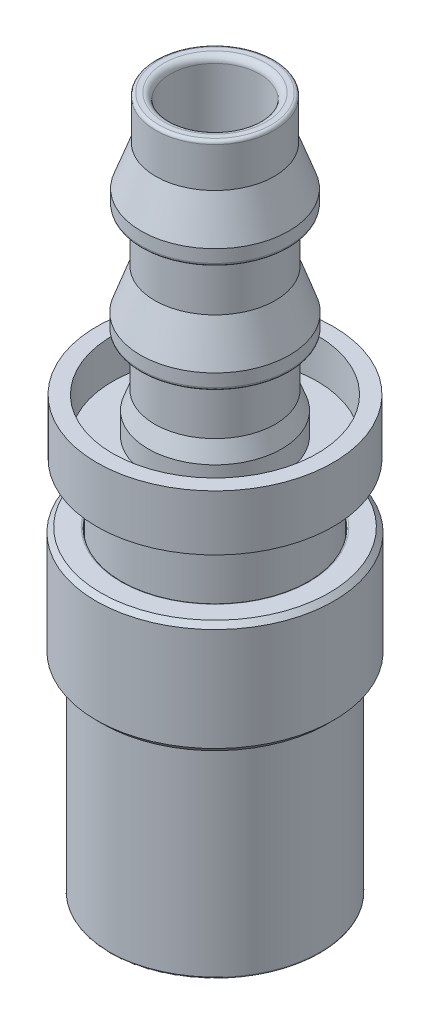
ISO-10303-21;
HEADER;
FILE_DESCRIPTION(('STEP AP214'),'2;1');
FILE_NAME('part.step','',(''),(''),'','','');
FILE_SCHEMA(('AUTOMOTIVE_DESIGN { 1 0 10303 214 1 1 1 1 }'));
ENDSEC;
DATA;
#1=APPLICATION_CONTEXT('core data for automotive mechanical design processes');
#2=APPLICATION_PROTOCOL_DEFINITION('international standard','automotive_design',2000,#1);
#3=PRODUCT_CONTEXT('',#1,'mechanical');
#4=PRODUCT('Part','Part','',(#3));
#5=PRODUCT_RELATED_PRODUCT_CATEGORY('part','',(#4));
#6=PRODUCT_DEFINITION_FORMATION('','',#4);
#7=PRODUCT_DEFINITION_CONTEXT('part definition',#1,'design');
#8=PRODUCT_DEFINITION('design','',#6,#7);
#9=PRODUCT_DEFINITION_SHAPE('','',#8);
#10=(LENGTH_UNIT() NAMED_UNIT(*) SI_UNIT(.MILLI.,.METRE.));
#11=(NAMED_UNIT(*) PLANE_ANGLE_UNIT() SI_UNIT($,.RADIAN.));
#12=(NAMED_UNIT(*) SI_UNIT($,.STERADIAN.) SOLID_ANGLE_UNIT());
#13=UNCERTAINTY_MEASURE_WITH_UNIT(LENGTH_MEASURE(1.E-05),#10,'distance_accuracy_value','');
#14=(GEOMETRIC_REPRESENTATION_CONTEXT(3) GLOBAL_UNCERTAINTY_ASSIGNED_CONTEXT((#13)) GLOBAL_UNIT_ASSIGNED_CONTEXT((#10,
#11,#12)) REPRESENTATION_CONTEXT('',''));
#15=CARTESIAN_POINT('',(0.,0.,0.));
#16=DIRECTION('',(0.,0.,1.));
#17=DIRECTION('',(1.,0.,0.));
#18=AXIS2_PLACEMENT_3D('',#15,#16,#17);
#19=CARTESIAN_POINT('',(0.,25.2095,0.));
#20=DIRECTION('',(0.,-1.,0.));
#21=DIRECTION('',(0.,0.,-1.));
#22=AXIS2_PLACEMENT_3D('',#19,#20,#21);
#23=CONICAL_SURFACE('',#22,9.3345,0.785398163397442);
#24=CARTESIAN_POINT('',(0.,25.4,0.));
#25=DIRECTION('',(0.,-1.,0.));
#26=DIRECTION('',(0.,0.,-1.));
#27=AXIS2_PLACEMENT_3D('',#24,#25,#26);
#28=CIRCLE('',#27,9.144);
#29=CARTESIAN_POINT('',(0.,25.4,9.144));
#30=VERTEX_POINT('',#29);
#31=EDGE_CURVE('P0_E11',#30,#30,#28,.T.);
#32=ORIENTED_EDGE('',*,*,#31,.T.);
#33=DIRECTION('',(0.,-0.707106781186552,0.707106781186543));
#34=VECTOR('',#33,1.);
#35=CARTESIAN_POINT('',(0.,25.2095,9.3345));
#36=LINE('',#35,#34);
#37=CARTESIAN_POINT('',(0.,25.019,9.525));
#38=VERTEX_POINT('',#37);
#39=EDGE_CURVE('P0_E27',#30,#38,#36,.T.);
#40=ORIENTED_EDGE('',*,*,#39,.T.);
#41=CARTESIAN_POINT('',(0.,25.019,0.));
#42=DIRECTION('',(0.,1.,0.));
#43=DIRECTION('',(0.,0.,-1.));
#44=AXIS2_PLACEMENT_3D('',#41,#42,#43);
#45=CIRCLE('',#44,9.525);
#46=CARTESIAN_POINT('',(0.,25.019,-9.525));
#47=VERTEX_POINT('',#46);
#48=EDGE_CURVE('P0_E168',#38,#47,#45,.T.);
#49=ORIENTED_EDGE('',*,*,#48,.T.);
#50=CARTESIAN_POINT('',(0.,25.019,0.));
#51=DIRECTION('',(0.,1.,0.));
#52=DIRECTION('',(0.,0.,-1.));
#53=AXIS2_PLACEMENT_3D('',#50,#51,#52);
#54=CIRCLE('',#53,9.525);
#55=EDGE_CURVE('P0_E272',#47,#38,#54,.T.);
#56=ORIENTED_EDGE('',*,*,#55,.T.);
#57=ORIENTED_EDGE('',*,*,#39,.F.);
#58=EDGE_LOOP('',(#32,#40,#49,#56,#57));
#59=FACE_BOUND('',#58,.T.);
#60=ADVANCED_FACE('P0_F16',(#59),#23,.T.);
#61=CARTESIAN_POINT('',(0.,20.828,0.));
#62=DIRECTION('',(0.,1.,0.));
#63=DIRECTION('',(0.,0.,1.));
#64=AXIS2_PLACEMENT_3D('',#61,#62,#63);
#65=CYLINDRICAL_SURFACE('',#64,9.525);
#66=ORIENTED_EDGE('',*,*,#48,.F.);
#67=ORIENTED_EDGE('',*,*,#55,.F.);
#68=DIRECTION('',(0.,-1.,0.));
#69=VECTOR('',#68,1.);
#70=CARTESIAN_POINT('',(0.,20.828,-9.525));
#71=LINE('',#70,#69);
#72=CARTESIAN_POINT('',(0.,16.764,-9.525));
#73=VERTEX_POINT('',#72);
#74=EDGE_CURVE('P0_E202',#47,#73,#71,.T.);
#75=ORIENTED_EDGE('',*,*,#74,.T.);
#76=CARTESIAN_POINT('',(0.,16.764,0.));
#77=DIRECTION('',(0.,-1.,0.));
#78=DIRECTION('',(0.,0.,-1.));
#79=AXIS2_PLACEMENT_3D('',#76,#77,#78);
#80=CIRCLE('',#79,9.525);
#81=CARTESIAN_POINT('',(0.,16.764,9.525));
#82=VERTEX_POINT('',#81);
#83=EDGE_CURVE('P0_E146',#82,#73,#80,.T.);
#84=ORIENTED_EDGE('',*,*,#83,.F.);
#85=CARTESIAN_POINT('',(0.,16.764,0.));
#86=DIRECTION('',(0.,-1.,0.));
#87=DIRECTION('',(0.,0.,-1.));
#88=AXIS2_PLACEMENT_3D('',#85,#86,#87);
#89=CIRCLE('',#88,9.525);
#90=EDGE_CURVE('P0_E207',#73,#82,#89,.T.);
#91=ORIENTED_EDGE('',*,*,#90,.F.);
#92=ORIENTED_EDGE('',*,*,#74,.F.);
#93=EDGE_LOOP('',(#66,#67,#75,#84,#91,#92));
#94=FACE_BOUND('',#93,.T.);
#95=ADVANCED_FACE('P0_F367',(#94),#65,.T.);
#96=CARTESIAN_POINT('',(0.,25.4,7.4549));
#97=DIRECTION('',(0.,1.,0.));
#98=DIRECTION('',(1.,0.,0.));
#99=AXIS2_PLACEMENT_3D('',#96,#97,#98);
#100=PLANE('',#99);
#101=ORIENTED_EDGE('',*,*,#31,.F.);
#102=EDGE_LOOP('',(#101));
#103=FACE_BOUND('',#102,.T.);
#104=CARTESIAN_POINT('',(0.,25.4,0.));
#105=DIRECTION('',(0.,1.,0.));
#106=DIRECTION('',(0.,0.,-1.));
#107=AXIS2_PLACEMENT_3D('',#104,#105,#106);
#108=CIRCLE('',#107,7.5819);
#109=CARTESIAN_POINT('',(0.,25.4,-7.5819));
#110=VERTEX_POINT('',#109);
#111=EDGE_CURVE('P0_E237',#110,#110,#108,.T.);
#112=ORIENTED_EDGE('',*,*,#111,.F.);
#113=EDGE_LOOP('',(#112));
#114=FACE_BOUND('',#113,.T.);
#115=ADVANCED_FACE('P0_F373',(#103,#114),#100,.T.);
#116=CARTESIAN_POINT('',(0.,6.096,0.));
#117=DIRECTION('',(0.,1.,0.));
#118=DIRECTION('',(0.,0.,1.));
#119=AXIS2_PLACEMENT_3D('',#116,#117,#118);
#120=TOROIDAL_SURFACE('',#119,6.6802,0.254);
#121=CARTESIAN_POINT('',(0.,6.096,0.));
#122=DIRECTION('',(0.,-1.,0.));
#123=DIRECTION('',(0.,0.,-1.));
#124=AXIS2_PLACEMENT_3D('',#121,#122,#123);
#125=CIRCLE('',#124,6.4262);
#126=CARTESIAN_POINT('',(0.,6.096,6.4262));
#127=VERTEX_POINT('',#126);
#128=CARTESIAN_POINT('',(0.,6.096,-6.4262));
#129=VERTEX_POINT('',#128);
#130=EDGE_CURVE('P0_E199',#127,#129,#125,.T.);
#131=ORIENTED_EDGE('',*,*,#130,.T.);
#132=CARTESIAN_POINT('',(0.,6.096,-6.6802));
#133=DIRECTION('',(-1.,0.,0.));
#134=DIRECTION('',(0.,0.,-1.));
#135=AXIS2_PLACEMENT_3D('',#132,#133,#134);
#136=CIRCLE('',#135,0.254);
#137=CARTESIAN_POINT('',(0.,6.35,-6.6802));
#138=VERTEX_POINT('',#137);
#139=EDGE_CURVE('P0_E188',#129,#138,#136,.T.);
#140=ORIENTED_EDGE('',*,*,#139,.T.);
#141=CARTESIAN_POINT('',(0.,6.35,0.));
#142=DIRECTION('',(0.,1.,0.));
#143=DIRECTION('',(0.,0.,-1.));
#144=AXIS2_PLACEMENT_3D('',#141,#142,#143);
#145=CIRCLE('',#144,6.6802);
#146=CARTESIAN_POINT('',(0.,6.35,6.6802));
#147=VERTEX_POINT('',#146);
#148=EDGE_CURVE('P0_E184',#138,#147,#145,.T.);
#149=ORIENTED_EDGE('',*,*,#148,.T.);
#150=CARTESIAN_POINT('',(0.,6.35,0.));
#151=DIRECTION('',(0.,1.,0.));
#152=DIRECTION('',(0.,0.,-1.));
#153=AXIS2_PLACEMENT_3D('',#150,#151,#152);
#154=CIRCLE('',#153,6.6802);
#155=EDGE_CURVE('P0_E189',#147,#138,#154,.T.);
#156=ORIENTED_EDGE('',*,*,#155,.T.);
#157=ORIENTED_EDGE('',*,*,#139,.F.);
#158=CARTESIAN_POINT('',(0.,6.096,0.));
#159=DIRECTION('',(0.,-1.,0.));
#160=DIRECTION('',(0.,0.,-1.));
#161=AXIS2_PLACEMENT_3D('',#158,#159,#160);
#162=CIRCLE('',#161,6.4262);
#163=EDGE_CURVE('P0_E193',#129,#127,#162,.T.);
#164=ORIENTED_EDGE('',*,*,#163,.T.);
#165=EDGE_LOOP('',(#131,#140,#149,#156,#157,#164));
#166=FACE_BOUND('',#165,.T.);
#167=ADVANCED_FACE('P0_F302',(#166),#120,.T.);
#168=CARTESIAN_POINT('',(0.,6.35,6.4262));
#169=DIRECTION('',(0.,1.,0.));
#170=DIRECTION('',(1.,0.,0.));
#171=AXIS2_PLACEMENT_3D('',#168,#169,#170);
#172=PLANE('',#171);
#173=CARTESIAN_POINT('',(0.,6.35,0.));
#174=DIRECTION('',(0.,-1.,0.));
#175=DIRECTION('',(0.,0.,-1.));
#176=AXIS2_PLACEMENT_3D('',#173,#174,#175);
#177=CIRCLE('',#176,7.2009);
#178=CARTESIAN_POINT('',(0.,6.35,7.2009));
#179=VERTEX_POINT('',#178);
#180=CARTESIAN_POINT('',(0.,6.35,-7.2009));
#181=VERTEX_POINT('',#180);
#182=EDGE_CURVE('P0_E138',#179,#181,#177,.T.);
#183=ORIENTED_EDGE('',*,*,#182,.F.);
#184=CARTESIAN_POINT('',(0.,6.35,0.));
#185=DIRECTION('',(0.,-1.,0.));
#186=DIRECTION('',(0.,0.,-1.));
#187=AXIS2_PLACEMENT_3D('',#184,#185,#186);
#188=CIRCLE('',#187,7.2009);
#189=EDGE_CURVE('P0_E143',#181,#179,#188,.T.);
#190=ORIENTED_EDGE('',*,*,#189,.F.);
#191=EDGE_LOOP('',(#183,#190));
#192=FACE_BOUND('',#191,.T.);
#193=ORIENTED_EDGE('',*,*,#155,.F.);
#194=ORIENTED_EDGE('',*,*,#148,.F.);
#195=EDGE_LOOP('',(#193,#194));
#196=FACE_BOUND('',#195,.T.);
#197=ADVANCED_FACE('P0_F298',(#192,#196),#172,.T.);
#198=CARTESIAN_POINT('',(0.,4.1402,0.));
#199=DIRECTION('',(0.,1.,0.));
#200=DIRECTION('',(0.,0.,1.));
#201=AXIS2_PLACEMENT_3D('',#198,#199,#200);
#202=CYLINDRICAL_SURFACE('',#201,6.4262);
#203=ORIENTED_EDGE('',*,*,#130,.F.);
#204=ORIENTED_EDGE('',*,*,#163,.F.);
#205=DIRECTION('',(0.,-1.,0.));
#206=VECTOR('',#205,1.);
#207=CARTESIAN_POINT('',(0.,4.1402,-6.4262));
#208=LINE('',#207,#206);
#209=CARTESIAN_POINT('',(0.,1.9304,-6.4262));
#210=VERTEX_POINT('',#209);
#211=EDGE_CURVE('P0_E133',#129,#210,#208,.T.);
#212=ORIENTED_EDGE('',*,*,#211,.T.);
#213=CARTESIAN_POINT('',(0.,1.9304,0.));
#214=DIRECTION('',(0.,1.,0.));
#215=DIRECTION('',(1.,0.,0.));
#216=AXIS2_PLACEMENT_3D('',#213,#214,#215);
#217=CIRCLE('',#216,6.4262);
#218=CARTESIAN_POINT('',(0.,1.9304,6.4262));
#219=VERTEX_POINT('',#218);
#220=EDGE_CURVE('P0_E180',#219,#210,#217,.T.);
#221=ORIENTED_EDGE('',*,*,#220,.F.);
#222=CARTESIAN_POINT('',(0.,1.9304,0.));
#223=DIRECTION('',(0.,1.,0.));
#224=DIRECTION('',(1.,0.,0.));
#225=AXIS2_PLACEMENT_3D('',#222,#223,#224);
#226=CIRCLE('',#225,6.4262);
#227=EDGE_CURVE('P0_E160',#210,#219,#226,.T.);
#228=ORIENTED_EDGE('',*,*,#227,.F.);
#229=ORIENTED_EDGE('',*,*,#211,.F.);
#230=EDGE_LOOP('',(#203,#204,#212,#221,#228,#229));
#231=FACE_BOUND('',#230,.T.);
#232=ADVANCED_FACE('P0_F301',(#231),#202,.F.);
#233=CARTESIAN_POINT('',(0.,6.604,0.));
#234=DIRECTION('',(0.,1.,0.));
#235=DIRECTION('',(0.,0.,1.));
#236=AXIS2_PLACEMENT_3D('',#233,#234,#235);
#237=TOROIDAL_SURFACE('',#236,7.2009,0.254);
#238=CARTESIAN_POINT('',(0.,6.604,0.));
#239=DIRECTION('',(0.,1.,0.));
#240=DIRECTION('',(0.,0.,-1.));
#241=AXIS2_PLACEMENT_3D('',#238,#239,#240);
#242=CIRCLE('',#241,7.4549);
#243=CARTESIAN_POINT('',(0.,6.604,7.4549));
#244=VERTEX_POINT('',#243);
#245=CARTESIAN_POINT('',(0.,6.604,-7.4549));
#246=VERTEX_POINT('',#245);
#247=EDGE_CURVE('P0_E123',#244,#246,#242,.T.);
#248=ORIENTED_EDGE('',*,*,#247,.T.);
#249=CARTESIAN_POINT('',(0.,6.604,-7.2009));
#250=DIRECTION('',(-1.,0.,0.));
#251=DIRECTION('',(0.,0.,-1.));
#252=AXIS2_PLACEMENT_3D('',#249,#250,#251);
#253=CIRCLE('',#252,0.254);
#254=EDGE_CURVE('P0_E134',#246,#181,#253,.T.);
#255=ORIENTED_EDGE('',*,*,#254,.T.);
#256=ORIENTED_EDGE('',*,*,#189,.T.);
#257=ORIENTED_EDGE('',*,*,#182,.T.);
#258=ORIENTED_EDGE('',*,*,#254,.F.);
#259=CARTESIAN_POINT('',(0.,6.604,0.));
#260=DIRECTION('',(0.,1.,0.));
#261=DIRECTION('',(0.,0.,-1.));
#262=AXIS2_PLACEMENT_3D('',#259,#260,#261);
#263=CIRCLE('',#262,7.4549);
#264=EDGE_CURVE('P0_E127',#246,#244,#263,.T.);
#265=ORIENTED_EDGE('',*,*,#264,.T.);
#266=EDGE_LOOP('',(#248,#255,#256,#257,#258,#265));
#267=FACE_BOUND('',#266,.T.);
#268=ADVANCED_FACE('P0_F136',(#267),#237,.F.);
#269=CARTESIAN_POINT('',(0.,15.875,0.));
#270=DIRECTION('',(0.,1.,0.));
#271=DIRECTION('',(0.,0.,1.));
#272=AXIS2_PLACEMENT_3D('',#269,#270,#271);
#273=CYLINDRICAL_SURFACE('',#272,7.4549);
#274=CARTESIAN_POINT('',(0.,25.273,0.));
#275=DIRECTION('',(0.,-1.,0.));
#276=DIRECTION('',(0.,0.,-1.));
#277=AXIS2_PLACEMENT_3D('',#274,#275,#276);
#278=CIRCLE('',#277,7.4549);
#279=CARTESIAN_POINT('',(0.,25.273,7.4549));
#280=VERTEX_POINT('',#279);
#281=CARTESIAN_POINT('',(0.,25.273,-7.4549));
#282=VERTEX_POINT('',#281);
#283=EDGE_CURVE('P0_E169',#280,#282,#278,.T.);
#284=ORIENTED_EDGE('',*,*,#283,.F.);
#285=CARTESIAN_POINT('',(0.,25.273,0.));
#286=DIRECTION('',(0.,-1.,0.));
#287=DIRECTION('',(0.,0.,-1.));
#288=AXIS2_PLACEMENT_3D('',#285,#286,#287);
#289=CIRCLE('',#288,7.4549);
#290=EDGE_CURVE('P0_E233',#282,#280,#289,.T.);
#291=ORIENTED_EDGE('',*,*,#290,.F.);
#292=DIRECTION('',(0.,-1.,0.));
#293=VECTOR('',#292,1.);
#294=CARTESIAN_POINT('',(0.,15.875,-7.4549));
#295=LINE('',#294,#293);
#296=EDGE_CURVE('P0_E129',#282,#246,#295,.T.);
#297=ORIENTED_EDGE('',*,*,#296,.T.);
#298=ORIENTED_EDGE('',*,*,#247,.F.);
#299=ORIENTED_EDGE('',*,*,#264,.F.);
#300=ORIENTED_EDGE('',*,*,#296,.F.);
#301=EDGE_LOOP('',(#284,#291,#297,#298,#299,#300));
#302=FACE_BOUND('',#301,.T.);
#303=ADVANCED_FACE('P0_F125',(#302),#273,.F.);
#304=CARTESIAN_POINT('',(0.,16.51,0.));
#305=DIRECTION('',(0.,1.,0.));
#306=DIRECTION('',(0.,0.,-1.));
#307=AXIS2_PLACEMENT_3D('',#304,#305,#306);
#308=CONICAL_SURFACE('',#307,9.271,0.785398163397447);
#309=ORIENTED_EDGE('',*,*,#83,.T.);
#310=ORIENTED_EDGE('',*,*,#90,.T.);
#311=DIRECTION('',(0.,-0.707106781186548,-0.707106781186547));
#312=VECTOR('',#311,1.);
#313=CARTESIAN_POINT('',(0.,16.51,9.271));
#314=LINE('',#313,#312);
#315=CARTESIAN_POINT('',(0.,16.256,9.017));
#316=VERTEX_POINT('',#315);
#317=EDGE_CURVE('P0_E152',#82,#316,#314,.T.);
#318=ORIENTED_EDGE('',*,*,#317,.T.);
#319=CARTESIAN_POINT('',(0.,16.256,0.));
#320=DIRECTION('',(0.,1.,0.));
#321=DIRECTION('',(0.,0.,-1.));
#322=AXIS2_PLACEMENT_3D('',#319,#320,#321);
#323=CIRCLE('',#322,9.017);
#324=EDGE_CURVE('P0_E149',#316,#316,#323,.T.);
#325=ORIENTED_EDGE('',*,*,#324,.T.);
#326=ORIENTED_EDGE('',*,*,#317,.F.);
#327=EDGE_LOOP('',(#309,#310,#318,#325,#326));
#328=FACE_BOUND('',#327,.T.);
#329=ADVANCED_FACE('P0_F354',(#328),#308,.T.);
#330=CARTESIAN_POINT('',(0.,16.256,9.525));
#331=DIRECTION('',(0.,-1.,0.));
#332=DIRECTION('',(0.,0.,-1.));
#333=AXIS2_PLACEMENT_3D('',#330,#331,#332);
#334=PLANE('',#333);
#335=ORIENTED_EDGE('',*,*,#324,.F.);
#336=EDGE_LOOP('',(#335));
#337=FACE_BOUND('',#336,.T.);
#338=CARTESIAN_POINT('',(0.,16.256,0.));
#339=DIRECTION('',(0.,1.,0.));
#340=DIRECTION('',(1.,0.,0.));
#341=AXIS2_PLACEMENT_3D('',#338,#339,#340);
#342=CIRCLE('',#341,8.4328);
#343=CARTESIAN_POINT('',(0.,16.256,8.4328));
#344=VERTEX_POINT('',#343);
#345=CARTESIAN_POINT('',(0.,16.256,-8.4328));
#346=VERTEX_POINT('',#345);
#347=EDGE_CURVE('P0_E153',#344,#346,#342,.T.);
#348=ORIENTED_EDGE('',*,*,#347,.T.);
#349=CARTESIAN_POINT('',(0.,16.256,0.));
#350=DIRECTION('',(0.,1.,0.));
#351=DIRECTION('',(1.,0.,0.));
#352=AXIS2_PLACEMENT_3D('',#349,#350,#351);
#353=CIRCLE('',#352,8.4328);
#354=EDGE_CURVE('P0_E217',#346,#344,#353,.T.);
#355=ORIENTED_EDGE('',*,*,#354,.T.);
#356=EDGE_LOOP('',(#348,#355));
#357=FACE_BOUND('',#356,.T.);
#358=ADVANCED_FACE('P0_F352',(#337,#357),#334,.T.);
#359=CARTESIAN_POINT('',(0.,0.127,0.));
#360=DIRECTION('',(0.,1.,0.));
#361=DIRECTION('',(0.,0.,1.));
#362=AXIS2_PLACEMENT_3D('',#359,#360,#361);
#363=TOROIDAL_SURFACE('',#362,8.3058,0.127);
#364=CARTESIAN_POINT('',(0.,0.127,0.));
#365=DIRECTION('',(0.,-1.,0.));
#366=DIRECTION('',(0.,0.,-1.));
#367=AXIS2_PLACEMENT_3D('',#364,#365,#366);
#368=CIRCLE('',#367,8.4328);
#369=CARTESIAN_POINT('',(0.,0.127,8.4328));
#370=VERTEX_POINT('',#369);
#371=CARTESIAN_POINT('',(0.,0.127,-8.4328));
#372=VERTEX_POINT('',#371);
#373=EDGE_CURVE('P0_E221',#370,#372,#368,.T.);
#374=ORIENTED_EDGE('',*,*,#373,.T.);
#375=CARTESIAN_POINT('',(0.,0.127,-8.3058));
#376=DIRECTION('',(-1.,0.,0.));
#377=DIRECTION('',(0.,0.,-1.));
#378=AXIS2_PLACEMENT_3D('',#375,#376,#377);
#379=CIRCLE('',#378,0.127);
#380=CARTESIAN_POINT('',(0.,0.,-8.3058));
#381=VERTEX_POINT('',#380);
#382=EDGE_CURVE('P0_E259',#372,#381,#379,.T.);
#383=ORIENTED_EDGE('',*,*,#382,.T.);
#384=CARTESIAN_POINT('',(0.,0.,0.));
#385=DIRECTION('',(0.,1.,0.));
#386=DIRECTION('',(0.,0.,-1.));
#387=AXIS2_PLACEMENT_3D('',#384,#385,#386);
#388=CIRCLE('',#387,8.3058);
#389=CARTESIAN_POINT('',(0.,0.,8.3058));
#390=VERTEX_POINT('',#389);
#391=EDGE_CURVE('P0_E20',#381,#390,#388,.T.);
#392=ORIENTED_EDGE('',*,*,#391,.T.);
#393=CARTESIAN_POINT('',(0.,0.,0.));
#394=DIRECTION('',(0.,1.,0.));
#395=DIRECTION('',(0.,0.,-1.));
#396=AXIS2_PLACEMENT_3D('',#393,#394,#395);
#397=CIRCLE('',#396,8.3058);
#398=EDGE_CURVE('P0_E198',#390,#381,#397,.T.);
#399=ORIENTED_EDGE('',*,*,#398,.T.);
#400=ORIENTED_EDGE('',*,*,#382,.F.);
#401=CARTESIAN_POINT('',(0.,0.127,0.));
#402=DIRECTION('',(0.,-1.,0.));
#403=DIRECTION('',(0.,0.,-1.));
#404=AXIS2_PLACEMENT_3D('',#401,#402,#403);
#405=CIRCLE('',#404,8.4328);
#406=EDGE_CURVE('P0_E194',#372,#370,#405,.T.);
#407=ORIENTED_EDGE('',*,*,#406,.T.);
#408=EDGE_LOOP('',(#374,#383,#392,#399,#400,#407));
#409=FACE_BOUND('',#408,.T.);
#410=ADVANCED_FACE('P0_F18',(#409),#363,.T.);
#411=CARTESIAN_POINT('',(0.,0.,8.4328));
#412=DIRECTION('',(0.,-1.,0.));
#413=DIRECTION('',(0.,0.,-1.));
#414=AXIS2_PLACEMENT_3D('',#411,#412,#413);
#415=PLANE('',#414);
#416=ORIENTED_EDGE('',*,*,#398,.F.);
#417=ORIENTED_EDGE('',*,*,#391,.F.);
#418=EDGE_LOOP('',(#416,#417));
#419=FACE_BOUND('',#418,.T.);
#420=CARTESIAN_POINT('',(0.,0.,0.));
#421=DIRECTION('',(0.,-1.,0.));
#422=DIRECTION('',(0.,0.,-1.));
#423=AXIS2_PLACEMENT_3D('',#420,#421,#422);
#424=CIRCLE('',#423,7.4422);
#425=CARTESIAN_POINT('',(0.,0.,7.4422));
#426=VERTEX_POINT('',#425);
#427=CARTESIAN_POINT('',(0.,0.,-7.4422));
#428=VERTEX_POINT('',#427);
#429=EDGE_CURVE('P0_E212',#426,#428,#424,.T.);
#430=ORIENTED_EDGE('',*,*,#429,.F.);
#431=CARTESIAN_POINT('',(0.,0.,0.));
#432=DIRECTION('',(0.,-1.,0.));
#433=DIRECTION('',(0.,0.,-1.));
#434=AXIS2_PLACEMENT_3D('',#431,#432,#433);
#435=CIRCLE('',#434,7.4422);
#436=EDGE_CURVE('P0_E175',#428,#426,#435,.T.);
#437=ORIENTED_EDGE('',*,*,#436,.F.);
#438=EDGE_LOOP('',(#430,#437));
#439=FACE_BOUND('',#438,.T.);
#440=ADVANCED_FACE('P0_F347',(#419,#439),#415,.T.);
#441=CARTESIAN_POINT('',(0.,8.128,0.));
#442=DIRECTION('',(0.,1.,0.));
#443=DIRECTION('',(0.,0.,1.));
#444=AXIS2_PLACEMENT_3D('',#441,#442,#443);
#445=CYLINDRICAL_SURFACE('',#444,8.4328);
#446=ORIENTED_EDGE('',*,*,#347,.F.);
#447=ORIENTED_EDGE('',*,*,#354,.F.);
#448=DIRECTION('',(0.,-1.,0.));
#449=VECTOR('',#448,1.);
#450=CARTESIAN_POINT('',(0.,8.128,-8.4328));
#451=LINE('',#450,#449);
#452=EDGE_CURVE('P0_E173',#346,#372,#451,.T.);
#453=ORIENTED_EDGE('',*,*,#452,.T.);
#454=ORIENTED_EDGE('',*,*,#373,.F.);
#455=ORIENTED_EDGE('',*,*,#406,.F.);
#456=ORIENTED_EDGE('',*,*,#452,.F.);
#457=EDGE_LOOP('',(#446,#447,#453,#454,#455,#456));
#458=FACE_BOUND('',#457,.T.);
#459=ADVANCED_FACE('P0_F350',(#458),#445,.T.);
#460=CARTESIAN_POINT('',(0.,25.273,0.));
#461=DIRECTION('',(0.,1.,0.));
#462=DIRECTION('',(0.,0.,1.));
#463=AXIS2_PLACEMENT_3D('',#460,#461,#462);
#464=TOROIDAL_SURFACE('',#463,7.5819,0.127);
#465=ORIENTED_EDGE('',*,*,#283,.T.);
#466=CARTESIAN_POINT('',(0.,25.273,-7.5819));
#467=DIRECTION('',(-1.,0.,0.));
#468=DIRECTION('',(0.,0.,-1.));
#469=AXIS2_PLACEMENT_3D('',#466,#467,#468);
#470=CIRCLE('',#469,0.127);
#471=EDGE_CURVE('P0_E174',#282,#110,#470,.T.);
#472=ORIENTED_EDGE('',*,*,#471,.T.);
#473=ORIENTED_EDGE('',*,*,#111,.T.);
#474=ORIENTED_EDGE('',*,*,#471,.F.);
#475=ORIENTED_EDGE('',*,*,#290,.T.);
#476=EDGE_LOOP('',(#465,#472,#473,#474,#475));
#477=FACE_BOUND('',#476,.T.);
#478=ADVANCED_FACE('P0_F391',(#477),#464,.T.);
#479=CARTESIAN_POINT('',(0.,0.127,0.));
#480=DIRECTION('',(0.,1.,0.));
#481=DIRECTION('',(0.,0.,1.));
#482=AXIS2_PLACEMENT_3D('',#479,#480,#481);
#483=TOROIDAL_SURFACE('',#482,7.4422,0.127);
#484=ORIENTED_EDGE('',*,*,#429,.T.);
#485=CARTESIAN_POINT('',(0.,0.127,-7.4422));
#486=DIRECTION('',(-1.,0.,0.));
#487=DIRECTION('',(0.,0.,-1.));
#488=AXIS2_PLACEMENT_3D('',#485,#486,#487);
#489=CIRCLE('',#488,0.127);
#490=CARTESIAN_POINT('',(0.,0.127,-7.3152));
#491=VERTEX_POINT('',#490);
#492=EDGE_CURVE('P0_E208',#428,#491,#489,.T.);
#493=ORIENTED_EDGE('',*,*,#492,.T.);
#494=CARTESIAN_POINT('',(0.,0.127,0.));
#495=DIRECTION('',(0.,1.,0.));
#496=DIRECTION('',(0.,0.,-1.));
#497=AXIS2_PLACEMENT_3D('',#494,#495,#496);
#498=CIRCLE('',#497,7.3152);
#499=CARTESIAN_POINT('',(0.,0.127,7.3152));
#500=VERTEX_POINT('',#499);
#501=EDGE_CURVE('P0_E213',#491,#500,#498,.T.);
#502=ORIENTED_EDGE('',*,*,#501,.T.);
#503=CARTESIAN_POINT('',(0.,0.127,0.));
#504=DIRECTION('',(0.,1.,0.));
#505=DIRECTION('',(0.,0.,-1.));
#506=AXIS2_PLACEMENT_3D('',#503,#504,#505);
#507=CIRCLE('',#506,7.3152);
#508=EDGE_CURVE('P0_E179',#500,#491,#507,.T.);
#509=ORIENTED_EDGE('',*,*,#508,.T.);
#510=ORIENTED_EDGE('',*,*,#492,.F.);
#511=ORIENTED_EDGE('',*,*,#436,.T.);
#512=EDGE_LOOP('',(#484,#493,#502,#509,#510,#511));
#513=FACE_BOUND('',#512,.T.);
#514=ADVANCED_FACE('P0_F396',(#513),#483,.T.);
#515=CARTESIAN_POINT('',(0.,0.5207,0.));
#516=DIRECTION('',(0.,1.,0.));
#517=DIRECTION('',(0.,0.,1.));
#518=AXIS2_PLACEMENT_3D('',#515,#516,#517);
#519=CYLINDRICAL_SURFACE('',#518,7.3152);
#520=CARTESIAN_POINT('',(0.,1.0414,0.));
#521=DIRECTION('',(0.,1.,0.));
#522=DIRECTION('',(1.,0.,0.));
#523=AXIS2_PLACEMENT_3D('',#520,#521,#522);
#524=CIRCLE('',#523,7.3152);
#525=CARTESIAN_POINT('',(0.,1.0414,7.3152));
#526=VERTEX_POINT('',#525);
#527=CARTESIAN_POINT('',(0.,1.0414,-7.3152));
#528=VERTEX_POINT('',#527);
#529=EDGE_CURVE('P0_E158',#526,#528,#524,.T.);
#530=ORIENTED_EDGE('',*,*,#529,.T.);
#531=DIRECTION('',(0.,-1.,0.));
#532=VECTOR('',#531,1.);
#533=CARTESIAN_POINT('',(0.,0.5207,-7.3152));
#534=LINE('',#533,#532);
#535=EDGE_CURVE('P0_E154',#528,#491,#534,.T.);
#536=ORIENTED_EDGE('',*,*,#535,.T.);
#537=ORIENTED_EDGE('',*,*,#508,.F.);
#538=ORIENTED_EDGE('',*,*,#501,.F.);
#539=ORIENTED_EDGE('',*,*,#535,.F.);
#540=CARTESIAN_POINT('',(0.,1.0414,0.));
#541=DIRECTION('',(0.,1.,0.));
#542=DIRECTION('',(1.,0.,0.));
#543=AXIS2_PLACEMENT_3D('',#540,#541,#542);
#544=CIRCLE('',#543,7.3152);
#545=EDGE_CURVE('P0_E159',#528,#526,#544,.T.);
#546=ORIENTED_EDGE('',*,*,#545,.T.);
#547=EDGE_LOOP('',(#530,#536,#537,#538,#539,#546));
#548=FACE_BOUND('',#547,.T.);
#549=ADVANCED_FACE('P0_F383',(#548),#519,.F.);
#550=CARTESIAN_POINT('',(0.,1.4859,0.));
#551=DIRECTION('',(0.,-1.,0.));
#552=DIRECTION('',(0.,0.,1.));
#553=AXIS2_PLACEMENT_3D('',#550,#551,#552);
#554=CONICAL_SURFACE('',#553,6.8707,0.78539816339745);
#555=ORIENTED_EDGE('',*,*,#220,.T.);
#556=DIRECTION('',(0.,-0.707106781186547,-0.707106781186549));
#557=VECTOR('',#556,1.);
#558=CARTESIAN_POINT('',(0.,1.4859,-6.8707));
#559=LINE('',#558,#557);
#560=EDGE_CURVE('P0_E164',#210,#528,#559,.T.);
#561=ORIENTED_EDGE('',*,*,#560,.T.);
#562=ORIENTED_EDGE('',*,*,#529,.F.);
#563=ORIENTED_EDGE('',*,*,#545,.F.);
#564=ORIENTED_EDGE('',*,*,#560,.F.);
#565=ORIENTED_EDGE('',*,*,#227,.T.);
#566=EDGE_LOOP('',(#555,#561,#562,#563,#564,#565));
#567=FACE_BOUND('',#566,.T.);
#568=ADVANCED_FACE('P0_F380',(#567),#554,.F.);
#569=CLOSED_SHELL('',(#60,#95,#115,#167,#197,#232,#268,#303,#329,#358,#410,#440,#459,#478,#514,
#549,#568));
#570=MANIFOLD_SOLID_BREP('P0_B1',#569);
#571=CARTESIAN_POINT('',(0.,55.0418,0.));
#572=DIRECTION('',(0.,1.,0.));
#573=DIRECTION('',(0.,0.,1.));
#574=AXIS2_PLACEMENT_3D('',#571,#572,#573);
#575=TOROIDAL_SURFACE('',#574,4.0894,0.508);
#576=CARTESIAN_POINT('',(0.,55.0418,0.));
#577=DIRECTION('',(0.,-1.,0.));
#578=DIRECTION('',(0.,0.,-1.));
#579=AXIS2_PLACEMENT_3D('',#576,#577,#578);
#580=CIRCLE('',#579,3.5814);
#581=CARTESIAN_POINT('',(0.,55.0418,3.5814));
#582=VERTEX_POINT('',#581);
#583=CARTESIAN_POINT('',(0.,55.0418,-3.5814));
#584=VERTEX_POINT('',#583);
#585=EDGE_CURVE('P1_E11',#582,#584,#580,.T.);
#586=ORIENTED_EDGE('',*,*,#585,.T.);
#587=CARTESIAN_POINT('',(0.,55.0418,-4.0894));
#588=DIRECTION('',(-1.,0.,0.));
#589=DIRECTION('',(0.,0.,-1.));
#590=AXIS2_PLACEMENT_3D('',#587,#588,#589);
#591=CIRCLE('',#590,0.508);
#592=CARTESIAN_POINT('',(0.,55.5498,-4.0894));
#593=VERTEX_POINT('',#592);
#594=EDGE_CURVE('P1_E27',#584,#593,#591,.T.);
#595=ORIENTED_EDGE('',*,*,#594,.T.);
#596=CARTESIAN_POINT('',(0.,55.5498,0.));
#597=DIRECTION('',(0.,1.,0.));
#598=DIRECTION('',(0.,0.,-1.));
#599=AXIS2_PLACEMENT_3D('',#596,#597,#598);
#600=CIRCLE('',#599,4.0894);
#601=CARTESIAN_POINT('',(0.,55.5498,4.0894));
#602=VERTEX_POINT('',#601);
#603=EDGE_CURVE('P1_E359',#593,#602,#600,.T.);
#604=ORIENTED_EDGE('',*,*,#603,.T.);
#605=CARTESIAN_POINT('',(0.,55.5498,0.));
#606=DIRECTION('',(0.,1.,0.));
#607=DIRECTION('',(0.,0.,-1.));
#608=AXIS2_PLACEMENT_3D('',#605,#606,#607);
#609=CIRCLE('',#608,4.0894);
#610=EDGE_CURVE('P1_E355',#602,#593,#609,.T.);
#611=ORIENTED_EDGE('',*,*,#610,.T.);
#612=ORIENTED_EDGE('',*,*,#594,.F.);
#613=CARTESIAN_POINT('',(0.,55.0418,0.));
#614=DIRECTION('',(0.,-1.,0.));
#615=DIRECTION('',(0.,0.,-1.));
#616=AXIS2_PLACEMENT_3D('',#613,#614,#615);
#617=CIRCLE('',#616,3.5814);
#618=EDGE_CURVE('P1_E360',#584,#582,#617,.T.);
#619=ORIENTED_EDGE('',*,*,#618,.T.);
#620=EDGE_LOOP('',(#586,#595,#604,#611,#612,#619));
#621=FACE_BOUND('',#620,.T.);
#622=ADVANCED_FACE('P1_F16',(#621),#575,.T.);
#623=CARTESIAN_POINT('',(0.,55.5498,3.5814));
#624=DIRECTION('',(0.,1.,0.));
#625=DIRECTION('',(1.,0.,0.));
#626=AXIS2_PLACEMENT_3D('',#623,#624,#625);
#627=PLANE('',#626);
#628=CARTESIAN_POINT('',(0.,55.5498,0.));
#629=DIRECTION('',(0.,-1.,0.));
#630=DIRECTION('',(0.,0.,-1.));
#631=AXIS2_PLACEMENT_3D('',#628,#629,#630);
#632=CIRCLE('',#631,4.4958);
#633=CARTESIAN_POINT('',(0.,55.5498,4.4958));
#634=VERTEX_POINT('',#633);
#635=CARTESIAN_POINT('',(0.,55.5498,-4.4958));
#636=VERTEX_POINT('',#635);
#637=EDGE_CURVE('P1_E409',#634,#636,#632,.T.);
#638=ORIENTED_EDGE('',*,*,#637,.F.);
#639=CARTESIAN_POINT('',(0.,55.5498,0.));
#640=DIRECTION('',(0.,-1.,0.));
#641=DIRECTION('',(0.,0.,-1.));
#642=AXIS2_PLACEMENT_3D('',#639,#640,#641);
#643=CIRCLE('',#642,4.4958);
#644=EDGE_CURVE('P1_E443',#636,#634,#643,.T.);
#645=ORIENTED_EDGE('',*,*,#644,.F.);
#646=EDGE_LOOP('',(#638,#645));
#647=FACE_BOUND('',#646,.T.);
#648=ORIENTED_EDGE('',*,*,#610,.F.);
#649=ORIENTED_EDGE('',*,*,#603,.F.);
#650=EDGE_LOOP('',(#648,#649));
#651=FACE_BOUND('',#650,.T.);
#652=ADVANCED_FACE('P1_F18',(#647,#651),#627,.T.);
#653=CARTESIAN_POINT('',(0.,41.2623,0.));
#654=DIRECTION('',(0.,1.,0.));
#655=DIRECTION('',(0.,0.,1.));
#656=AXIS2_PLACEMENT_3D('',#653,#654,#655);
#657=CYLINDRICAL_SURFACE('',#656,3.5814);
#658=ORIENTED_EDGE('',*,*,#585,.F.);
#659=ORIENTED_EDGE('',*,*,#618,.F.);
#660=DIRECTION('',(0.,-1.,0.));
#661=VECTOR('',#660,1.);
#662=CARTESIAN_POINT('',(0.,41.2623,-3.5814));
#663=LINE('',#662,#661);
#664=CARTESIAN_POINT('',(0.,26.9748,-3.5814));
#665=VERTEX_POINT('',#664);
#666=EDGE_CURVE('P1_E397',#584,#665,#663,.T.);
#667=ORIENTED_EDGE('',*,*,#666,.T.);
#668=CARTESIAN_POINT('',(0.,26.9748,0.));
#669=DIRECTION('',(0.,1.,0.));
#670=DIRECTION('',(1.,0.,0.));
#671=AXIS2_PLACEMENT_3D('',#668,#669,#670);
#672=CIRCLE('',#671,3.5814);
#673=CARTESIAN_POINT('',(0.,26.9748,3.5814));
#674=VERTEX_POINT('',#673);
#675=EDGE_CURVE('P1_E525',#674,#665,#672,.T.);
#676=ORIENTED_EDGE('',*,*,#675,.F.);
#677=CARTESIAN_POINT('',(0.,26.9748,0.));
#678=DIRECTION('',(0.,1.,0.));
#679=DIRECTION('',(1.,0.,0.));
#680=AXIS2_PLACEMENT_3D('',#677,#678,#679);
#681=CIRCLE('',#680,3.5814);
#682=EDGE_CURVE('P1_E529',#665,#674,#681,.T.);
#683=ORIENTED_EDGE('',*,*,#682,.F.);
#684=ORIENTED_EDGE('',*,*,#666,.F.);
#685=EDGE_LOOP('',(#658,#659,#667,#676,#683,#684));
#686=FACE_BOUND('',#685,.T.);
#687=ADVANCED_FACE('P1_F738',(#686),#657,.F.);
#688=CARTESIAN_POINT('',(0.,0.254,0.));
#689=DIRECTION('',(0.,1.,0.));
#690=DIRECTION('',(0.,0.,1.));
#691=AXIS2_PLACEMENT_3D('',#688,#689,#690);
#692=TOROIDAL_SURFACE('',#691,6.096,0.254);
#693=CARTESIAN_POINT('',(0.,0.254,0.));
#694=DIRECTION('',(0.,-1.,0.));
#695=DIRECTION('',(0.,0.,-1.));
#696=AXIS2_PLACEMENT_3D('',#693,#694,#695);
#697=CIRCLE('',#696,6.35);
#698=CARTESIAN_POINT('',(0.,0.254,6.35));
#699=VERTEX_POINT('',#698);
#700=CARTESIAN_POINT('',(0.,0.254,-6.35));
#701=VERTEX_POINT('',#700);
#702=EDGE_CURVE('P1_E401',#699,#701,#697,.T.);
#703=ORIENTED_EDGE('',*,*,#702,.T.);
#704=CARTESIAN_POINT('',(0.,0.254,-6.096));
#705=DIRECTION('',(-1.,0.,0.));
#706=DIRECTION('',(0.,0.,-1.));
#707=AXIS2_PLACEMENT_3D('',#704,#705,#706);
#708=CIRCLE('',#707,0.254);
#709=CARTESIAN_POINT('',(0.,0.,-6.096));
#710=VERTEX_POINT('',#709);
#711=EDGE_CURVE('P1_E369',#701,#710,#708,.T.);
#712=ORIENTED_EDGE('',*,*,#711,.T.);
#713=CARTESIAN_POINT('',(0.,0.,0.));
#714=DIRECTION('',(0.,1.,0.));
#715=DIRECTION('',(0.,0.,-1.));
#716=AXIS2_PLACEMENT_3D('',#713,#714,#715);
#717=CIRCLE('',#716,6.096);
#718=CARTESIAN_POINT('',(0.,0.,6.096));
#719=VERTEX_POINT('',#718);
#720=EDGE_CURVE('P1_E366',#710,#719,#717,.T.);
#721=ORIENTED_EDGE('',*,*,#720,.T.);
#722=CARTESIAN_POINT('',(0.,0.,0.));
#723=DIRECTION('',(0.,1.,0.));
#724=DIRECTION('',(0.,0.,-1.));
#725=AXIS2_PLACEMENT_3D('',#722,#723,#724);
#726=CIRCLE('',#725,6.096);
#727=EDGE_CURVE('P1_E370',#719,#710,#726,.T.);
#728=ORIENTED_EDGE('',*,*,#727,.T.);
#729=ORIENTED_EDGE('',*,*,#711,.F.);
#730=CARTESIAN_POINT('',(0.,0.254,0.));
#731=DIRECTION('',(0.,-1.,0.));
#732=DIRECTION('',(0.,0.,-1.));
#733=AXIS2_PLACEMENT_3D('',#730,#731,#732);
#734=CIRCLE('',#733,6.35);
#735=EDGE_CURVE('P1_E424',#701,#699,#734,.T.);
#736=ORIENTED_EDGE('',*,*,#735,.T.);
#737=EDGE_LOOP('',(#703,#712,#721,#728,#729,#736));
#738=FACE_BOUND('',#737,.T.);
#739=ADVANCED_FACE('P1_F750',(#738),#692,.T.);
#740=CARTESIAN_POINT('',(0.,0.,6.35));
#741=DIRECTION('',(0.,-1.,0.));
#742=DIRECTION('',(0.,0.,-1.));
#743=AXIS2_PLACEMENT_3D('',#740,#741,#742);
#744=PLANE('',#743);
#745=ORIENTED_EDGE('',*,*,#727,.F.);
#746=ORIENTED_EDGE('',*,*,#720,.F.);
#747=EDGE_LOOP('',(#745,#746));
#748=FACE_BOUND('',#747,.T.);
#749=CARTESIAN_POINT('',(0.,0.,0.));
#750=DIRECTION('',(0.,-1.,0.));
#751=DIRECTION('',(0.,0.,-1.));
#752=AXIS2_PLACEMENT_3D('',#749,#750,#751);
#753=CIRCLE('',#752,5.5626);
#754=CARTESIAN_POINT('',(0.,0.,5.5626));
#755=VERTEX_POINT('',#754);
#756=EDGE_CURVE('P1_E20',#755,#755,#753,.T.);
#757=ORIENTED_EDGE('',*,*,#756,.F.);
#758=EDGE_LOOP('',(#757));
#759=FACE_BOUND('',#758,.T.);
#760=ADVANCED_FACE('P1_F754',(#748,#759),#744,.T.);
#761=CARTESIAN_POINT('',(0.,7.62,0.));
#762=DIRECTION('',(0.,1.,0.));
#763=DIRECTION('',(0.,0.,1.));
#764=AXIS2_PLACEMENT_3D('',#761,#762,#763);
#765=CYLINDRICAL_SURFACE('',#764,6.35);
#766=CARTESIAN_POINT('',(0.,15.24,0.));
#767=DIRECTION('',(0.,1.,0.));
#768=DIRECTION('',(1.,0.,0.));
#769=AXIS2_PLACEMENT_3D('',#766,#767,#768);
#770=CIRCLE('',#769,6.35);
#771=CARTESIAN_POINT('',(0.,15.24,6.35));
#772=VERTEX_POINT('',#771);
#773=CARTESIAN_POINT('',(0.,15.24,-6.35));
#774=VERTEX_POINT('',#773);
#775=EDGE_CURVE('P1_E522',#772,#774,#770,.T.);
#776=ORIENTED_EDGE('',*,*,#775,.F.);
#777=CARTESIAN_POINT('',(0.,15.24,0.));
#778=DIRECTION('',(0.,1.,0.));
#779=DIRECTION('',(1.,0.,0.));
#780=AXIS2_PLACEMENT_3D('',#777,#778,#779);
#781=CIRCLE('',#780,6.35);
#782=EDGE_CURVE('P1_E588',#774,#772,#781,.T.);
#783=ORIENTED_EDGE('',*,*,#782,.F.);
#784=DIRECTION('',(0.,-1.,0.));
#785=VECTOR('',#784,1.);
#786=CARTESIAN_POINT('',(0.,7.62,-6.35));
#787=LINE('',#786,#785);
#788=EDGE_CURVE('P1_E420',#774,#701,#787,.T.);
#789=ORIENTED_EDGE('',*,*,#788,.T.);
#790=ORIENTED_EDGE('',*,*,#702,.F.);
#791=ORIENTED_EDGE('',*,*,#735,.F.);
#792=ORIENTED_EDGE('',*,*,#788,.F.);
#793=EDGE_LOOP('',(#776,#783,#789,#790,#791,#792));
#794=FACE_BOUND('',#793,.T.);
#795=ADVANCED_FACE('P1_F726',(#794),#765,.T.);
#796=CARTESIAN_POINT('',(0.,39.2938,0.));
#797=DIRECTION('',(0.,1.,0.));
#798=DIRECTION('',(0.,0.,1.));
#799=AXIS2_PLACEMENT_3D('',#796,#797,#798);
#800=TOROIDAL_SURFACE('',#799,5.715,0.254);
#801=CARTESIAN_POINT('',(0.,39.2938,0.));
#802=DIRECTION('',(0.,-1.,0.));
#803=DIRECTION('',(0.,0.,-1.));
#804=AXIS2_PLACEMENT_3D('',#801,#802,#803);
#805=CIRCLE('',#804,5.969);
#806=CARTESIAN_POINT('',(0.,39.2938,5.969));
#807=VERTEX_POINT('',#806);
#808=CARTESIAN_POINT('',(0.,39.2938,-5.969));
#809=VERTEX_POINT('',#808);
#810=EDGE_CURVE('P1_E425',#807,#809,#805,.T.);
#811=ORIENTED_EDGE('',*,*,#810,.T.);
#812=CARTESIAN_POINT('',(0.,39.2938,-5.715));
#813=DIRECTION('',(-1.,0.,0.));
#814=DIRECTION('',(0.,0.,-1.));
#815=AXIS2_PLACEMENT_3D('',#812,#813,#814);
#816=CIRCLE('',#815,0.254);
#817=CARTESIAN_POINT('',(0.,39.0398,-5.715));
#818=VERTEX_POINT('',#817);
#819=EDGE_CURVE('P1_E316',#809,#818,#816,.T.);
#820=ORIENTED_EDGE('',*,*,#819,.T.);
#821=CARTESIAN_POINT('',(0.,39.0398,0.));
#822=DIRECTION('',(0.,1.,0.));
#823=DIRECTION('',(0.,0.,-1.));
#824=AXIS2_PLACEMENT_3D('',#821,#822,#823);
#825=CIRCLE('',#824,5.715);
#826=CARTESIAN_POINT('',(0.,39.0398,5.715));
#827=VERTEX_POINT('',#826);
#828=EDGE_CURVE('P1_E375',#818,#827,#825,.T.);
#829=ORIENTED_EDGE('',*,*,#828,.T.);
#830=CARTESIAN_POINT('',(0.,39.0398,0.));
#831=DIRECTION('',(0.,1.,0.));
#832=DIRECTION('',(0.,0.,-1.));
#833=AXIS2_PLACEMENT_3D('',#830,#831,#832);
#834=CIRCLE('',#833,5.715);
#835=EDGE_CURVE('P1_E371',#827,#818,#834,.T.);
#836=ORIENTED_EDGE('',*,*,#835,.T.);
#837=ORIENTED_EDGE('',*,*,#819,.F.);
#838=CARTESIAN_POINT('',(0.,39.2938,0.));
#839=DIRECTION('',(0.,-1.,0.));
#840=DIRECTION('',(0.,0.,-1.));
#841=AXIS2_PLACEMENT_3D('',#838,#839,#840);
#842=CIRCLE('',#841,5.969);
#843=EDGE_CURVE('P1_E376',#809,#807,#842,.T.);
#844=ORIENTED_EDGE('',*,*,#843,.T.);
#845=EDGE_LOOP('',(#811,#820,#829,#836,#837,#844));
#846=FACE_BOUND('',#845,.T.);
#847=ADVANCED_FACE('P1_F716',(#846),#800,.T.);
#848=CARTESIAN_POINT('',(0.,39.0398,5.969));
#849=DIRECTION('',(0.,-1.,0.));
#850=DIRECTION('',(0.,0.,-1.));
#851=AXIS2_PLACEMENT_3D('',#848,#849,#850);
#852=PLANE('',#851);
#853=ORIENTED_EDGE('',*,*,#835,.F.);
#854=ORIENTED_EDGE('',*,*,#828,.F.);
#855=EDGE_LOOP('',(#853,#854));
#856=FACE_BOUND('',#855,.T.);
#857=CARTESIAN_POINT('',(0.,39.0398,0.));
#858=DIRECTION('',(0.,1.,0.));
#859=DIRECTION('',(1.,0.,0.));
#860=AXIS2_PLACEMENT_3D('',#857,#858,#859);
#861=CIRCLE('',#860,4.826);
#862=CARTESIAN_POINT('',(0.,39.0398,4.826));
#863=VERTEX_POINT('',#862);
#864=CARTESIAN_POINT('',(0.,39.0398,-4.826));
#865=VERTEX_POINT('',#864);
#866=EDGE_CURVE('P1_E405',#863,#865,#861,.T.);
#867=ORIENTED_EDGE('',*,*,#866,.T.);
#868=CARTESIAN_POINT('',(0.,39.0398,0.));
#869=DIRECTION('',(0.,1.,0.));
#870=DIRECTION('',(1.,0.,0.));
#871=AXIS2_PLACEMENT_3D('',#868,#869,#870);
#872=CIRCLE('',#871,4.826);
#873=EDGE_CURVE('P1_E451',#865,#863,#872,.T.);
#874=ORIENTED_EDGE('',*,*,#873,.T.);
#875=EDGE_LOOP('',(#867,#874));
#876=FACE_BOUND('',#875,.T.);
#877=ADVANCED_FACE('P1_F713',(#856,#876),#852,.T.);
#878=CARTESIAN_POINT('',(0.,39.6748,0.));
#879=DIRECTION('',(0.,1.,0.));
#880=DIRECTION('',(0.,0.,1.));
#881=AXIS2_PLACEMENT_3D('',#878,#879,#880);
#882=CYLINDRICAL_SURFACE('',#881,5.969);
#883=CARTESIAN_POINT('',(0.,40.3098,0.));
#884=DIRECTION('',(0.,1.,0.));
#885=DIRECTION('',(1.,0.,0.));
#886=AXIS2_PLACEMENT_3D('',#883,#884,#885);
#887=CIRCLE('',#886,5.969);
#888=CARTESIAN_POINT('',(0.,40.3098,5.969));
#889=VERTEX_POINT('',#888);
#890=CARTESIAN_POINT('',(0.,40.3098,-5.969));
#891=VERTEX_POINT('',#890);
#892=EDGE_CURVE('P1_E327',#889,#891,#887,.T.);
#893=ORIENTED_EDGE('',*,*,#892,.F.);
#894=CARTESIAN_POINT('',(0.,40.3098,0.));
#895=DIRECTION('',(0.,1.,0.));
#896=DIRECTION('',(1.,0.,0.));
#897=AXIS2_PLACEMENT_3D('',#894,#895,#896);
#898=CIRCLE('',#897,5.969);
#899=EDGE_CURVE('P1_E322',#891,#889,#898,.T.);
#900=ORIENTED_EDGE('',*,*,#899,.F.);
#901=DIRECTION('',(0.,-1.,0.));
#902=VECTOR('',#901,1.);
#903=CARTESIAN_POINT('',(0.,39.6748,-5.969));
#904=LINE('',#903,#902);
#905=EDGE_CURVE('P1_E447',#891,#809,#904,.T.);
#906=ORIENTED_EDGE('',*,*,#905,.T.);
#907=ORIENTED_EDGE('',*,*,#810,.F.);
#908=ORIENTED_EDGE('',*,*,#843,.F.);
#909=ORIENTED_EDGE('',*,*,#905,.F.);
#910=EDGE_LOOP('',(#893,#900,#906,#907,#908,#909));
#911=FACE_BOUND('',#910,.T.);
#912=ADVANCED_FACE('P1_F715',(#911),#882,.T.);
#913=CARTESIAN_POINT('',(0.,47.879,0.));
#914=DIRECTION('',(0.,1.,0.));
#915=DIRECTION('',(0.,0.,1.));
#916=AXIS2_PLACEMENT_3D('',#913,#914,#915);
#917=TOROIDAL_SURFACE('',#916,5.6642,0.254);
#918=CARTESIAN_POINT('',(0.,47.879,0.));
#919=DIRECTION('',(0.,-1.,0.));
#920=DIRECTION('',(0.,0.,-1.));
#921=AXIS2_PLACEMENT_3D('',#918,#919,#920);
#922=CIRCLE('',#921,5.9182);
#923=CARTESIAN_POINT('',(0.,47.879,5.9182));
#924=VERTEX_POINT('',#923);
#925=CARTESIAN_POINT('',(0.,47.879,-5.9182));
#926=VERTEX_POINT('',#925);
#927=EDGE_CURVE('P1_E452',#924,#926,#922,.T.);
#928=ORIENTED_EDGE('',*,*,#927,.T.);
#929=CARTESIAN_POINT('',(0.,47.879,-5.6642));
#930=DIRECTION('',(-1.,0.,0.));
#931=DIRECTION('',(0.,0.,-1.));
#932=AXIS2_PLACEMENT_3D('',#929,#930,#931);
#933=CIRCLE('',#932,0.254);
#934=CARTESIAN_POINT('',(0.,47.625,-5.6642));
#935=VERTEX_POINT('',#934);
#936=EDGE_CURVE('P1_E298',#926,#935,#933,.T.);
#937=ORIENTED_EDGE('',*,*,#936,.T.);
#938=CARTESIAN_POINT('',(0.,47.625,0.));
#939=DIRECTION('',(0.,1.,0.));
#940=DIRECTION('',(0.,0.,-1.));
#941=AXIS2_PLACEMENT_3D('',#938,#939,#940);
#942=CIRCLE('',#941,5.6642);
#943=CARTESIAN_POINT('',(0.,47.625,5.6642));
#944=VERTEX_POINT('',#943);
#945=EDGE_CURVE('P1_E292',#935,#944,#942,.T.);
#946=ORIENTED_EDGE('',*,*,#945,.T.);
#947=CARTESIAN_POINT('',(0.,47.625,0.));
#948=DIRECTION('',(0.,1.,0.));
#949=DIRECTION('',(0.,0.,-1.));
#950=AXIS2_PLACEMENT_3D('',#947,#948,#949);
#951=CIRCLE('',#950,5.6642);
#952=EDGE_CURVE('P1_E297',#944,#935,#951,.T.);
#953=ORIENTED_EDGE('',*,*,#952,.T.);
#954=ORIENTED_EDGE('',*,*,#936,.F.);
#955=CARTESIAN_POINT('',(0.,47.879,0.));
#956=DIRECTION('',(0.,-1.,0.));
#957=DIRECTION('',(0.,0.,-1.));
#958=AXIS2_PLACEMENT_3D('',#955,#956,#957);
#959=CIRCLE('',#958,5.9182);
#960=EDGE_CURVE('P1_E305',#926,#924,#959,.T.);
#961=ORIENTED_EDGE('',*,*,#960,.T.);
#962=EDGE_LOOP('',(#928,#937,#946,#953,#954,#961));
#963=FACE_BOUND('',#962,.T.);
#964=ADVANCED_FACE('P1_F295',(#963),#917,.T.);
#965=CARTESIAN_POINT('',(0.,47.625,5.9182));
#966=DIRECTION('',(0.,-1.,0.));
#967=DIRECTION('',(0.,0.,-1.));
#968=AXIS2_PLACEMENT_3D('',#965,#966,#967);
#969=PLANE('',#968);
#970=ORIENTED_EDGE('',*,*,#952,.F.);
#971=ORIENTED_EDGE('',*,*,#945,.F.);
#972=EDGE_LOOP('',(#970,#971));
#973=FACE_BOUND('',#972,.T.);
#974=CARTESIAN_POINT('',(0.,47.625,0.));
#975=DIRECTION('',(0.,1.,0.));
#976=DIRECTION('',(1.,0.,0.));
#977=AXIS2_PLACEMENT_3D('',#974,#975,#976);
#978=CIRCLE('',#977,4.826);
#979=CARTESIAN_POINT('',(0.,47.625,4.826));
#980=VERTEX_POINT('',#979);
#981=CARTESIAN_POINT('',(0.,47.625,-4.826));
#982=VERTEX_POINT('',#981);
#983=EDGE_CURVE('P1_E312',#980,#982,#978,.T.);
#984=ORIENTED_EDGE('',*,*,#983,.T.);
#985=CARTESIAN_POINT('',(0.,47.625,0.));
#986=DIRECTION('',(0.,1.,0.));
#987=DIRECTION('',(1.,0.,0.));
#988=AXIS2_PLACEMENT_3D('',#985,#986,#987);
#989=CIRCLE('',#988,4.826);
#990=EDGE_CURVE('P1_E464',#982,#980,#989,.T.);
#991=ORIENTED_EDGE('',*,*,#990,.T.);
#992=EDGE_LOOP('',(#984,#991));
#993=FACE_BOUND('',#992,.T.);
#994=ADVANCED_FACE('P1_F302',(#973,#993),#969,.T.);
#995=CARTESIAN_POINT('',(0.,48.26,0.));
#996=DIRECTION('',(0.,1.,0.));
#997=DIRECTION('',(0.,0.,1.));
#998=AXIS2_PLACEMENT_3D('',#995,#996,#997);
#999=CYLINDRICAL_SURFACE('',#998,5.9182);
#1000=CARTESIAN_POINT('',(0.,48.895,0.));
#1001=DIRECTION('',(0.,1.,0.));
#1002=DIRECTION('',(1.,0.,0.));
#1003=AXIS2_PLACEMENT_3D('',#1000,#1001,#1002);
#1004=CIRCLE('',#1003,5.9182);
#1005=CARTESIAN_POINT('',(0.,48.895,5.9182));
#1006=VERTEX_POINT('',#1005);
#1007=CARTESIAN_POINT('',(0.,48.895,-5.9182));
#1008=VERTEX_POINT('',#1007);
#1009=EDGE_CURVE('P1_E528',#1006,#1008,#1004,.T.);
#1010=ORIENTED_EDGE('',*,*,#1009,.F.);
#1011=CARTESIAN_POINT('',(0.,48.895,0.));
#1012=DIRECTION('',(0.,1.,0.));
#1013=DIRECTION('',(1.,0.,0.));
#1014=AXIS2_PLACEMENT_3D('',#1011,#1012,#1013);
#1015=CIRCLE('',#1014,5.9182);
#1016=EDGE_CURVE('P1_E492',#1008,#1006,#1015,.T.);
#1017=ORIENTED_EDGE('',*,*,#1016,.F.);
#1018=DIRECTION('',(0.,-1.,0.));
#1019=VECTOR('',#1018,1.);
#1020=CARTESIAN_POINT('',(0.,48.26,-5.9182));
#1021=LINE('',#1020,#1019);
#1022=EDGE_CURVE('P1_E500',#1008,#926,#1021,.T.);
#1023=ORIENTED_EDGE('',*,*,#1022,.T.);
#1024=ORIENTED_EDGE('',*,*,#927,.F.);
#1025=ORIENTED_EDGE('',*,*,#960,.F.);
#1026=ORIENTED_EDGE('',*,*,#1022,.F.);
#1027=EDGE_LOOP('',(#1010,#1017,#1023,#1024,#1025,#1026));
#1028=FACE_BOUND('',#1027,.T.);
#1029=ADVANCED_FACE('P1_F766',(#1028),#999,.T.);
#1030=CARTESIAN_POINT('',(0.,55.2958,0.));
#1031=DIRECTION('',(0.,1.,0.));
#1032=DIRECTION('',(0.,0.,1.));
#1033=AXIS2_PLACEMENT_3D('',#1030,#1031,#1032);
#1034=TOROIDAL_SURFACE('',#1033,4.4958,0.254);
#1035=ORIENTED_EDGE('',*,*,#637,.T.);
#1036=CARTESIAN_POINT('',(0.,55.2958,-4.4958));
#1037=DIRECTION('',(-1.,0.,0.));
#1038=DIRECTION('',(0.,0.,-1.));
#1039=AXIS2_PLACEMENT_3D('',#1036,#1037,#1038);
#1040=CIRCLE('',#1039,0.254);
#1041=CARTESIAN_POINT('',(0.,55.2958,-4.7498));
#1042=VERTEX_POINT('',#1041);
#1043=EDGE_CURVE('P1_E386',#636,#1042,#1040,.T.);
#1044=ORIENTED_EDGE('',*,*,#1043,.T.);
#1045=CARTESIAN_POINT('',(0.,55.2958,0.));
#1046=DIRECTION('',(0.,1.,0.));
#1047=DIRECTION('',(0.,0.,-1.));
#1048=AXIS2_PLACEMENT_3D('',#1045,#1046,#1047);
#1049=CIRCLE('',#1048,4.7498);
#1050=CARTESIAN_POINT('',(0.,55.2958,4.7498));
#1051=VERTEX_POINT('',#1050);
#1052=EDGE_CURVE('P1_E383',#1042,#1051,#1049,.T.);
#1053=ORIENTED_EDGE('',*,*,#1052,.T.);
#1054=CARTESIAN_POINT('',(0.,55.2958,0.));
#1055=DIRECTION('',(0.,1.,0.));
#1056=DIRECTION('',(0.,0.,-1.));
#1057=AXIS2_PLACEMENT_3D('',#1054,#1055,#1056);
#1058=CIRCLE('',#1057,4.7498);
#1059=EDGE_CURVE('P1_E387',#1051,#1042,#1058,.T.);
#1060=ORIENTED_EDGE('',*,*,#1059,.T.);
#1061=ORIENTED_EDGE('',*,*,#1043,.F.);
#1062=ORIENTED_EDGE('',*,*,#644,.T.);
#1063=EDGE_LOOP('',(#1035,#1044,#1053,#1060,#1061,#1062));
#1064=FACE_BOUND('',#1063,.T.);
#1065=ADVANCED_FACE('P1_F777',(#1064),#1034,.T.);
#1066=CARTESIAN_POINT('',(0.,53.8274763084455,0.));
#1067=DIRECTION('',(0.,1.,0.));
#1068=DIRECTION('',(0.,0.,1.));
#1069=AXIS2_PLACEMENT_3D('',#1066,#1067,#1068);
#1070=CYLINDRICAL_SURFACE('',#1069,4.7498);
#1071=ORIENTED_EDGE('',*,*,#1059,.F.);
#1072=ORIENTED_EDGE('',*,*,#1052,.F.);
#1073=DIRECTION('',(0.,-1.,0.));
#1074=VECTOR('',#1073,1.);
#1075=CARTESIAN_POINT('',(0.,53.8274763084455,-4.7498));
#1076=LINE('',#1075,#1074);
#1077=CARTESIAN_POINT('',(0.,52.1051526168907,-4.7498));
#1078=VERTEX_POINT('',#1077);
#1079=EDGE_CURVE('P1_E473',#1042,#1078,#1076,.T.);
#1080=ORIENTED_EDGE('',*,*,#1079,.T.);
#1081=CARTESIAN_POINT('',(0.,52.1051526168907,0.));
#1082=DIRECTION('',(0.,1.,0.));
#1083=DIRECTION('',(1.,0.,0.));
#1084=AXIS2_PLACEMENT_3D('',#1081,#1082,#1083);
#1085=CIRCLE('',#1084,4.7498);
#1086=CARTESIAN_POINT('',(0.,52.1051526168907,4.7498));
#1087=VERTEX_POINT('',#1086);
#1088=EDGE_CURVE('P1_E446',#1078,#1087,#1085,.T.);
#1089=ORIENTED_EDGE('',*,*,#1088,.T.);
#1090=CARTESIAN_POINT('',(0.,52.1051526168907,0.));
#1091=DIRECTION('',(0.,1.,0.));
#1092=DIRECTION('',(1.,0.,0.));
#1093=AXIS2_PLACEMENT_3D('',#1090,#1091,#1092);
#1094=CIRCLE('',#1093,4.7498);
#1095=EDGE_CURVE('P1_E353',#1087,#1078,#1094,.T.);
#1096=ORIENTED_EDGE('',*,*,#1095,.T.);
#1097=ORIENTED_EDGE('',*,*,#1079,.F.);
#1098=EDGE_LOOP('',(#1071,#1072,#1080,#1089,#1096,#1097));
#1099=FACE_BOUND('',#1098,.T.);
#1100=ADVANCED_FACE('P1_F780',(#1099),#1070,.T.);
#1101=CARTESIAN_POINT('',(0.,29.8958,0.));
#1102=DIRECTION('',(0.,1.,0.));
#1103=DIRECTION('',(0.,0.,1.));
#1104=AXIS2_PLACEMENT_3D('',#1101,#1102,#1103);
#1105=TOROIDAL_SURFACE('',#1104,7.1501,0.254);
#1106=CARTESIAN_POINT('',(0.,30.1498,0.));
#1107=DIRECTION('',(0.,-1.,0.));
#1108=DIRECTION('',(0.,0.,-1.));
#1109=AXIS2_PLACEMENT_3D('',#1106,#1107,#1108);
#1110=CIRCLE('',#1109,7.1501);
#1111=CARTESIAN_POINT('',(0.,30.1498,7.1501));
#1112=VERTEX_POINT('',#1111);
#1113=CARTESIAN_POINT('',(0.,30.1498,-7.1501));
#1114=VERTEX_POINT('',#1113);
#1115=EDGE_CURVE('P1_E349',#1112,#1114,#1110,.T.);
#1116=ORIENTED_EDGE('',*,*,#1115,.T.);
#1117=CARTESIAN_POINT('',(0.,29.8958,-7.1501));
#1118=DIRECTION('',(-1.,0.,0.));
#1119=DIRECTION('',(0.,0.,-1.));
#1120=AXIS2_PLACEMENT_3D('',#1117,#1118,#1119);
#1121=CIRCLE('',#1120,0.254);
#1122=CARTESIAN_POINT('',(0.,29.8958,-7.4041));
#1123=VERTEX_POINT('',#1122);
#1124=EDGE_CURVE('P1_E354',#1114,#1123,#1121,.T.);
#1125=ORIENTED_EDGE('',*,*,#1124,.T.);
#1126=CARTESIAN_POINT('',(0.,29.8958,0.));
#1127=DIRECTION('',(0.,1.,0.));
#1128=DIRECTION('',(0.,0.,-1.));
#1129=AXIS2_PLACEMENT_3D('',#1126,#1127,#1128);
#1130=CIRCLE('',#1129,7.4041);
#1131=CARTESIAN_POINT('',(0.,29.8958,7.4041));
#1132=VERTEX_POINT('',#1131);
#1133=EDGE_CURVE('P1_E493',#1123,#1132,#1130,.T.);
#1134=ORIENTED_EDGE('',*,*,#1133,.T.);
#1135=CARTESIAN_POINT('',(0.,29.8958,0.));
#1136=DIRECTION('',(0.,1.,0.));
#1137=DIRECTION('',(0.,0.,-1.));
#1138=AXIS2_PLACEMENT_3D('',#1135,#1136,#1137);
#1139=CIRCLE('',#1138,7.4041);
#1140=EDGE_CURVE('P1_E332',#1132,#1123,#1139,.T.);
#1141=ORIENTED_EDGE('',*,*,#1140,.T.);
#1142=ORIENTED_EDGE('',*,*,#1124,.F.);
#1143=CARTESIAN_POINT('',(0.,30.1498,0.));
#1144=DIRECTION('',(0.,-1.,0.));
#1145=DIRECTION('',(0.,0.,-1.));
#1146=AXIS2_PLACEMENT_3D('',#1143,#1144,#1145);
#1147=CIRCLE('',#1146,7.1501);
#1148=EDGE_CURVE('P1_E328',#1114,#1112,#1147,.T.);
#1149=ORIENTED_EDGE('',*,*,#1148,.T.);
#1150=EDGE_LOOP('',(#1116,#1125,#1134,#1141,#1142,#1149));
#1151=FACE_BOUND('',#1150,.T.);
#1152=ADVANCED_FACE('P1_F785',(#1151),#1105,.T.);
#1153=CARTESIAN_POINT('',(0.,22.6949,0.));
#1154=DIRECTION('',(0.,1.,0.));
#1155=DIRECTION('',(0.,0.,1.));
#1156=AXIS2_PLACEMENT_3D('',#1153,#1154,#1155);
#1157=CYLINDRICAL_SURFACE('',#1156,7.4041);
#1158=DIRECTION('',(0.,-1.,0.));
#1159=VECTOR('',#1158,1.);
#1160=CARTESIAN_POINT('',(0.,22.6949,-7.4041));
#1161=LINE('',#1160,#1159);
#1162=CARTESIAN_POINT('',(0.,28.1939996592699,-7.4041));
#1163=VERTEX_POINT('',#1162);
#1164=EDGE_CURVE('P1_E40',#1123,#1163,#1161,.T.);
#1165=ORIENTED_EDGE('',*,*,#1164,.T.);
#1166=ORIENTED_EDGE('',*,*,#1164,.F.);
#1167=ORIENTED_EDGE('',*,*,#1140,.F.);
#1168=ORIENTED_EDGE('',*,*,#1133,.F.);
#1169=EDGE_LOOP('',(#1165,#1166,#1167,#1168));
#1170=FACE_BOUND('',#1169,.T.);
#1171=DIRECTION('',(0.,-1.,0.));
#1172=VECTOR('',#1171,1.);
#1173=CARTESIAN_POINT('',(0.,22.6949,-7.4041));
#1174=LINE('',#1173,#1172);
#1175=CARTESIAN_POINT('',(0.,25.3999996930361,-7.4041));
#1176=VERTEX_POINT('',#1175);
#1177=CARTESIAN_POINT('',(0.,15.494,-7.4041));
#1178=VERTEX_POINT('',#1177);
#1179=EDGE_CURVE('P1_E318',#1176,#1178,#1174,.T.);
#1180=ORIENTED_EDGE('',*,*,#1179,.F.);
#1181=ORIENTED_EDGE('',*,*,#1179,.T.);
#1182=CARTESIAN_POINT('',(0.,15.494,0.));
#1183=DIRECTION('',(0.,-1.,0.));
#1184=DIRECTION('',(0.,0.,-1.));
#1185=AXIS2_PLACEMENT_3D('',#1182,#1183,#1184);
#1186=CIRCLE('',#1185,7.4041);
#1187=CARTESIAN_POINT('',(0.,15.494,7.4041));
#1188=VERTEX_POINT('',#1187);
#1189=EDGE_CURVE('P1_E321',#1188,#1178,#1186,.T.);
#1190=ORIENTED_EDGE('',*,*,#1189,.F.);
#1191=CARTESIAN_POINT('',(0.,15.494,0.));
#1192=DIRECTION('',(0.,-1.,0.));
#1193=DIRECTION('',(0.,0.,-1.));
#1194=AXIS2_PLACEMENT_3D('',#1191,#1192,#1193);
#1195=CIRCLE('',#1194,7.4041);
#1196=EDGE_CURVE('P1_E479',#1178,#1188,#1195,.T.);
#1197=ORIENTED_EDGE('',*,*,#1196,.F.);
#1198=EDGE_LOOP('',(#1180,#1181,#1190,#1197));
#1199=FACE_BOUND('',#1198,.T.);
#1200=ADVANCED_FACE('P1_F782',(#1170,#1199),#1157,.T.);
#1201=CARTESIAN_POINT('',(0.,30.1498,4.9784));
#1202=DIRECTION('',(0.,1.,0.));
#1203=DIRECTION('',(1.,0.,0.));
#1204=AXIS2_PLACEMENT_3D('',#1201,#1202,#1203);
#1205=PLANE('',#1204);
#1206=ORIENTED_EDGE('',*,*,#1115,.F.);
#1207=ORIENTED_EDGE('',*,*,#1148,.F.);
#1208=EDGE_LOOP('',(#1206,#1207));
#1209=FACE_BOUND('',#1208,.T.);
#1210=CARTESIAN_POINT('',(0.,30.1498,0.));
#1211=DIRECTION('',(0.,1.,0.));
#1212=DIRECTION('',(1.,0.,0.));
#1213=AXIS2_PLACEMENT_3D('',#1210,#1211,#1212);
#1214=CIRCLE('',#1213,4.9784);
#1215=CARTESIAN_POINT('',(0.,30.1498,4.9784));
#1216=VERTEX_POINT('',#1215);
#1217=CARTESIAN_POINT('',(0.,30.1498,-4.9784));
#1218=VERTEX_POINT('',#1217);
#1219=EDGE_CURVE('P1_E337',#1216,#1218,#1214,.T.);
#1220=ORIENTED_EDGE('',*,*,#1219,.F.);
#1221=CARTESIAN_POINT('',(0.,30.1498,0.));
#1222=DIRECTION('',(0.,1.,0.));
#1223=DIRECTION('',(1.,0.,0.));
#1224=AXIS2_PLACEMENT_3D('',#1221,#1222,#1223);
#1225=CIRCLE('',#1224,4.9784);
#1226=EDGE_CURVE('P1_E487',#1218,#1216,#1225,.T.);
#1227=ORIENTED_EDGE('',*,*,#1226,.F.);
#1228=EDGE_LOOP('',(#1220,#1227));
#1229=FACE_BOUND('',#1228,.T.);
#1230=ADVANCED_FACE('P1_F784',(#1209,#1229),#1205,.T.);
#1231=CARTESIAN_POINT('',(0.,15.494,0.));
#1232=DIRECTION('',(0.,1.,0.));
#1233=DIRECTION('',(0.,0.,1.));
#1234=AXIS2_PLACEMENT_3D('',#1231,#1232,#1233);
#1235=TOROIDAL_SURFACE('',#1234,7.1501,0.254);
#1236=ORIENTED_EDGE('',*,*,#1189,.T.);
#1237=CARTESIAN_POINT('',(0.,15.494,-7.1501));
#1238=DIRECTION('',(-1.,0.,0.));
#1239=DIRECTION('',(0.,0.,-1.));
#1240=AXIS2_PLACEMENT_3D('',#1237,#1238,#1239);
#1241=CIRCLE('',#1240,0.254);
#1242=CARTESIAN_POINT('',(0.,15.24,-7.1501));
#1243=VERTEX_POINT('',#1242);
#1244=EDGE_CURVE('P1_E469',#1178,#1243,#1241,.T.);
#1245=ORIENTED_EDGE('',*,*,#1244,.T.);
#1246=CARTESIAN_POINT('',(0.,15.24,0.));
#1247=DIRECTION('',(0.,1.,0.));
#1248=DIRECTION('',(0.,0.,-1.));
#1249=AXIS2_PLACEMENT_3D('',#1246,#1247,#1248);
#1250=CIRCLE('',#1249,7.1501);
#1251=CARTESIAN_POINT('',(0.,15.24,7.1501));
#1252=VERTEX_POINT('',#1251);
#1253=EDGE_CURVE('P1_E478',#1243,#1252,#1250,.T.);
#1254=ORIENTED_EDGE('',*,*,#1253,.T.);
#1255=CARTESIAN_POINT('',(0.,15.24,0.));
#1256=DIRECTION('',(0.,1.,0.));
#1257=DIRECTION('',(0.,0.,-1.));
#1258=AXIS2_PLACEMENT_3D('',#1255,#1256,#1257);
#1259=CIRCLE('',#1258,7.1501);
#1260=EDGE_CURVE('P1_E474',#1252,#1243,#1259,.T.);
#1261=ORIENTED_EDGE('',*,*,#1260,.T.);
#1262=ORIENTED_EDGE('',*,*,#1244,.F.);
#1263=ORIENTED_EDGE('',*,*,#1196,.T.);
#1264=EDGE_LOOP('',(#1236,#1245,#1254,#1261,#1262,#1263));
#1265=FACE_BOUND('',#1264,.T.);
#1266=ADVANCED_FACE('P1_F786',(#1265),#1235,.T.);
#1267=CARTESIAN_POINT('',(0.,15.24,7.4041));
#1268=DIRECTION('',(0.,-1.,0.));
#1269=DIRECTION('',(0.,0.,-1.));
#1270=AXIS2_PLACEMENT_3D('',#1267,#1268,#1269);
#1271=PLANE('',#1270);
#1272=ORIENTED_EDGE('',*,*,#1260,.F.);
#1273=ORIENTED_EDGE('',*,*,#1253,.F.);
#1274=EDGE_LOOP('',(#1272,#1273));
#1275=FACE_BOUND('',#1274,.T.);
#1276=ORIENTED_EDGE('',*,*,#775,.T.);
#1277=ORIENTED_EDGE('',*,*,#782,.T.);
#1278=EDGE_LOOP('',(#1276,#1277));
#1279=FACE_BOUND('',#1278,.T.);
#1280=ADVANCED_FACE('P1_F788',(#1275,#1279),#1271,.T.);
#1281=CARTESIAN_POINT('',(0.,0.3937,0.));
#1282=DIRECTION('',(0.,-1.,0.));
#1283=DIRECTION('',(0.,0.,-1.));
#1284=AXIS2_PLACEMENT_3D('',#1281,#1282,#1283);
#1285=CONICAL_SURFACE('',#1284,5.1689,0.785398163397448);
#1286=ORIENTED_EDGE('',*,*,#756,.T.);
#1287=DIRECTION('',(0.,0.707106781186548,-0.707106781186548));
#1288=VECTOR('',#1287,1.);
#1289=CARTESIAN_POINT('',(0.,0.3937,5.1689));
#1290=LINE('',#1289,#1288);
#1291=CARTESIAN_POINT('',(0.,0.7874,4.7752));
#1292=VERTEX_POINT('',#1291);
#1293=EDGE_CURVE('P1_E648',#755,#1292,#1290,.T.);
#1294=ORIENTED_EDGE('',*,*,#1293,.T.);
#1295=CARTESIAN_POINT('',(0.,0.7874,0.));
#1296=DIRECTION('',(0.,1.,0.));
#1297=DIRECTION('',(0.,0.,-1.));
#1298=AXIS2_PLACEMENT_3D('',#1295,#1296,#1297);
#1299=CIRCLE('',#1298,4.7752);
#1300=CARTESIAN_POINT('',(0.,0.7874,-4.7752));
#1301=VERTEX_POINT('',#1300);
#1302=EDGE_CURVE('P1_E641',#1292,#1301,#1299,.T.);
#1303=ORIENTED_EDGE('',*,*,#1302,.T.);
#1304=CARTESIAN_POINT('',(0.,0.7874,0.));
#1305=DIRECTION('',(0.,1.,0.));
#1306=DIRECTION('',(0.,0.,-1.));
#1307=AXIS2_PLACEMENT_3D('',#1304,#1305,#1306);
#1308=CIRCLE('',#1307,4.7752);
#1309=EDGE_CURVE('P1_E414',#1301,#1292,#1308,.T.);
#1310=ORIENTED_EDGE('',*,*,#1309,.T.);
#1311=ORIENTED_EDGE('',*,*,#1293,.F.);
#1312=EDGE_LOOP('',(#1286,#1294,#1303,#1310,#1311));
#1313=FACE_BOUND('',#1312,.T.);
#1314=ADVANCED_FACE('P1_F794',(#1313),#1285,.F.);
#1315=CARTESIAN_POINT('',(0.,4.05954416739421,0.));
#1316=DIRECTION('',(0.,1.,0.));
#1317=DIRECTION('',(0.,0.,1.));
#1318=AXIS2_PLACEMENT_3D('',#1315,#1316,#1317);
#1319=CYLINDRICAL_SURFACE('',#1318,4.7752);
#1320=CARTESIAN_POINT('',(0.,8.11908833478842,0.));
#1321=DIRECTION('',(0.,1.,0.));
#1322=DIRECTION('',(1.,0.,0.));
#1323=AXIS2_PLACEMENT_3D('',#1320,#1321,#1322);
#1324=CIRCLE('',#1323,4.7752);
#1325=CARTESIAN_POINT('',(0.,8.11908833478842,4.7752));
#1326=VERTEX_POINT('',#1325);
#1327=CARTESIAN_POINT('',(0.,8.11908833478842,-4.7752));
#1328=VERTEX_POINT('',#1327);
#1329=EDGE_CURVE('P1_E410',#1326,#1328,#1324,.T.);
#1330=ORIENTED_EDGE('',*,*,#1329,.T.);
#1331=DIRECTION('',(0.,-1.,0.));
#1332=VECTOR('',#1331,1.);
#1333=CARTESIAN_POINT('',(0.,4.05954416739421,-4.7752));
#1334=LINE('',#1333,#1332);
#1335=EDGE_CURVE('P1_E415',#1328,#1301,#1334,.T.);
#1336=ORIENTED_EDGE('',*,*,#1335,.T.);
#1337=ORIENTED_EDGE('',*,*,#1302,.F.);
#1338=ORIENTED_EDGE('',*,*,#1309,.F.);
#1339=ORIENTED_EDGE('',*,*,#1335,.F.);
#1340=CARTESIAN_POINT('',(0.,8.11908833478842,0.));
#1341=DIRECTION('',(0.,1.,0.));
#1342=DIRECTION('',(1.,0.,0.));
#1343=AXIS2_PLACEMENT_3D('',#1340,#1341,#1342);
#1344=CIRCLE('',#1343,4.7752);
#1345=EDGE_CURVE('P1_E419',#1328,#1326,#1344,.T.);
#1346=ORIENTED_EDGE('',*,*,#1345,.T.);
#1347=EDGE_LOOP('',(#1330,#1336,#1337,#1338,#1339,#1346));
#1348=FACE_BOUND('',#1347,.T.);
#1349=ADVANCED_FACE('P1_F746',(#1348),#1319,.F.);
#1350=CARTESIAN_POINT('',(0.,12.2174,0.));
#1351=DIRECTION('',(0.,1.,0.));
#1352=DIRECTION('',(0.,0.,1.));
#1353=AXIS2_PLACEMENT_3D('',#1350,#1351,#1352);
#1354=CYLINDRICAL_SURFACE('',#1353,5.0546);
#1355=CARTESIAN_POINT('',(0.,12.8524,0.));
#1356=DIRECTION('',(0.,1.,0.));
#1357=DIRECTION('',(1.,0.,0.));
#1358=AXIS2_PLACEMENT_3D('',#1355,#1356,#1357);
#1359=CIRCLE('',#1358,5.0546);
#1360=CARTESIAN_POINT('',(0.,12.8524,5.0546));
#1361=VERTEX_POINT('',#1360);
#1362=CARTESIAN_POINT('',(0.,12.8524,-5.0546));
#1363=VERTEX_POINT('',#1362);
#1364=EDGE_CURVE('P1_E435',#1361,#1363,#1359,.T.);
#1365=ORIENTED_EDGE('',*,*,#1364,.T.);
#1366=DIRECTION('',(0.,-1.,0.));
#1367=VECTOR('',#1366,1.);
#1368=CARTESIAN_POINT('',(0.,12.2174,-5.0546));
#1369=LINE('',#1368,#1367);
#1370=CARTESIAN_POINT('',(0.,11.5824,-5.0546));
#1371=VERTEX_POINT('',#1370);
#1372=EDGE_CURVE('P1_E430',#1363,#1371,#1369,.T.);
#1373=ORIENTED_EDGE('',*,*,#1372,.T.);
#1374=CARTESIAN_POINT('',(0.,11.5824,0.));
#1375=DIRECTION('',(0.,1.,0.));
#1376=DIRECTION('',(1.,0.,0.));
#1377=AXIS2_PLACEMENT_3D('',#1374,#1375,#1376);
#1378=CIRCLE('',#1377,5.0546);
#1379=CARTESIAN_POINT('',(0.,11.5824,5.0546));
#1380=VERTEX_POINT('',#1379);
#1381=EDGE_CURVE('P1_E431',#1380,#1371,#1378,.T.);
#1382=ORIENTED_EDGE('',*,*,#1381,.F.);
#1383=CARTESIAN_POINT('',(0.,11.5824,0.));
#1384=DIRECTION('',(0.,1.,0.));
#1385=DIRECTION('',(1.,0.,0.));
#1386=AXIS2_PLACEMENT_3D('',#1383,#1384,#1385);
#1387=CIRCLE('',#1386,5.0546);
#1388=EDGE_CURVE('P1_E484',#1371,#1380,#1387,.T.);
#1389=ORIENTED_EDGE('',*,*,#1388,.F.);
#1390=ORIENTED_EDGE('',*,*,#1372,.F.);
#1391=CARTESIAN_POINT('',(0.,12.8524,0.));
#1392=DIRECTION('',(0.,1.,0.));
#1393=DIRECTION('',(1.,0.,0.));
#1394=AXIS2_PLACEMENT_3D('',#1391,#1392,#1393);
#1395=CIRCLE('',#1394,5.0546);
#1396=EDGE_CURVE('P1_E426',#1363,#1361,#1395,.T.);
#1397=ORIENTED_EDGE('',*,*,#1396,.T.);
#1398=EDGE_LOOP('',(#1365,#1373,#1382,#1389,#1390,#1397));
#1399=FACE_BOUND('',#1398,.T.);
#1400=ADVANCED_FACE('P1_F666',(#1399),#1354,.F.);
#1401=CARTESIAN_POINT('',(0.,11.4650824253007,0.));
#1402=DIRECTION('',(0.,-1.,0.));
#1403=DIRECTION('',(0.,0.,1.));
#1404=AXIS2_PLACEMENT_3D('',#1401,#1402,#1403);
#1405=CONICAL_SURFACE('',#1404,5.2578,1.04719755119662);
#1406=ORIENTED_EDGE('',*,*,#1381,.T.);
#1407=DIRECTION('',(0.,-0.499999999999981,-0.86602540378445));
#1408=VECTOR('',#1407,1.);
#1409=CARTESIAN_POINT('',(0.,11.4650824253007,-5.2578));
#1410=LINE('',#1409,#1408);
#1411=CARTESIAN_POINT('',(0.,11.3477648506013,-5.461));
#1412=VERTEX_POINT('',#1411);
#1413=EDGE_CURVE('P1_E480',#1371,#1412,#1410,.T.);
#1414=ORIENTED_EDGE('',*,*,#1413,.T.);
#1415=CARTESIAN_POINT('',(0.,11.3477648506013,0.));
#1416=DIRECTION('',(0.,1.,0.));
#1417=DIRECTION('',(1.,0.,0.));
#1418=AXIS2_PLACEMENT_3D('',#1415,#1416,#1417);
#1419=CIRCLE('',#1418,5.461);
#1420=CARTESIAN_POINT('',(0.,11.3477648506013,5.461));
#1421=VERTEX_POINT('',#1420);
#1422=EDGE_CURVE('P1_E627',#1421,#1412,#1419,.T.);
#1423=ORIENTED_EDGE('',*,*,#1422,.F.);
#1424=CARTESIAN_POINT('',(0.,11.3477648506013,0.));
#1425=DIRECTION('',(0.,1.,0.));
#1426=DIRECTION('',(1.,0.,0.));
#1427=AXIS2_PLACEMENT_3D('',#1424,#1425,#1426);
#1428=CIRCLE('',#1427,5.461);
#1429=EDGE_CURVE('P1_E381',#1412,#1421,#1428,.T.);
#1430=ORIENTED_EDGE('',*,*,#1429,.F.);
#1431=ORIENTED_EDGE('',*,*,#1413,.F.);
#1432=ORIENTED_EDGE('',*,*,#1388,.T.);
#1433=EDGE_LOOP('',(#1406,#1414,#1423,#1430,#1431,#1432));
#1434=FACE_BOUND('',#1433,.T.);
#1435=ADVANCED_FACE('P1_F663',(#1434),#1405,.F.);
#1436=CARTESIAN_POINT('',(0.,10.3952648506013,0.));
#1437=DIRECTION('',(0.,1.,0.));
#1438=DIRECTION('',(0.,0.,1.));
#1439=AXIS2_PLACEMENT_3D('',#1436,#1437,#1438);
#1440=CYLINDRICAL_SURFACE('',#1439,5.461);
#1441=ORIENTED_EDGE('',*,*,#1422,.T.);
#1442=DIRECTION('',(0.,-1.,0.));
#1443=VECTOR('',#1442,1.);
#1444=CARTESIAN_POINT('',(0.,10.3952648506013,-5.461));
#1445=LINE('',#1444,#1443);
#1446=CARTESIAN_POINT('',(0.,9.44276485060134,-5.461));
#1447=VERTEX_POINT('',#1446);
#1448=EDGE_CURVE('P1_E587',#1412,#1447,#1445,.T.);
#1449=ORIENTED_EDGE('',*,*,#1448,.T.);
#1450=CARTESIAN_POINT('',(0.,9.44276485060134,0.));
#1451=DIRECTION('',(0.,1.,0.));
#1452=DIRECTION('',(1.,0.,0.));
#1453=AXIS2_PLACEMENT_3D('',#1450,#1451,#1452);
#1454=CIRCLE('',#1453,5.461);
#1455=CARTESIAN_POINT('',(0.,9.44276485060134,5.461));
#1456=VERTEX_POINT('',#1455);
#1457=EDGE_CURVE('P1_E377',#1456,#1447,#1454,.T.);
#1458=ORIENTED_EDGE('',*,*,#1457,.F.);
#1459=CARTESIAN_POINT('',(0.,9.44276485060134,0.));
#1460=DIRECTION('',(0.,1.,0.));
#1461=DIRECTION('',(1.,0.,0.));
#1462=AXIS2_PLACEMENT_3D('',#1459,#1460,#1461);
#1463=CIRCLE('',#1462,5.461);
#1464=EDGE_CURVE('P1_E634',#1447,#1456,#1463,.T.);
#1465=ORIENTED_EDGE('',*,*,#1464,.F.);
#1466=ORIENTED_EDGE('',*,*,#1448,.F.);
#1467=ORIENTED_EDGE('',*,*,#1429,.T.);
#1468=EDGE_LOOP('',(#1441,#1449,#1458,#1465,#1466,#1467));
#1469=FACE_BOUND('',#1468,.T.);
#1470=ADVANCED_FACE('P1_F827',(#1469),#1440,.F.);
#1471=CARTESIAN_POINT('',(0.,9.325447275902,0.));
#1472=DIRECTION('',(0.,1.,0.));
#1473=DIRECTION('',(0.,0.,1.));
#1474=AXIS2_PLACEMENT_3D('',#1471,#1472,#1473);
#1475=CONICAL_SURFACE('',#1474,5.2578,1.04719755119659);
#1476=ORIENTED_EDGE('',*,*,#1457,.T.);
#1477=DIRECTION('',(0.,-0.500000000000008,0.866025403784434));
#1478=VECTOR('',#1477,1.);
#1479=CARTESIAN_POINT('',(0.,9.325447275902,-5.2578));
#1480=LINE('',#1479,#1478);
#1481=CARTESIAN_POINT('',(0.,9.20812970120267,-5.0546));
#1482=VERTEX_POINT('',#1481);
#1483=EDGE_CURVE('P1_E382',#1447,#1482,#1480,.T.);
#1484=ORIENTED_EDGE('',*,*,#1483,.T.);
#1485=CARTESIAN_POINT('',(0.,9.20812970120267,0.));
#1486=DIRECTION('',(0.,1.,0.));
#1487=DIRECTION('',(1.,0.,0.));
#1488=AXIS2_PLACEMENT_3D('',#1485,#1486,#1487);
#1489=CIRCLE('',#1488,5.0546);
#1490=CARTESIAN_POINT('',(0.,9.20812970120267,5.0546));
#1491=VERTEX_POINT('',#1490);
#1492=EDGE_CURVE('P1_E365',#1491,#1482,#1489,.T.);
#1493=ORIENTED_EDGE('',*,*,#1492,.F.);
#1494=CARTESIAN_POINT('',(0.,9.20812970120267,0.));
#1495=DIRECTION('',(0.,1.,0.));
#1496=DIRECTION('',(1.,0.,0.));
#1497=AXIS2_PLACEMENT_3D('',#1494,#1495,#1496);
#1498=CIRCLE('',#1497,5.0546);
#1499=EDGE_CURVE('P1_E343',#1482,#1491,#1498,.T.);
#1500=ORIENTED_EDGE('',*,*,#1499,.F.);
#1501=ORIENTED_EDGE('',*,*,#1483,.F.);
#1502=ORIENTED_EDGE('',*,*,#1464,.T.);
#1503=EDGE_LOOP('',(#1476,#1484,#1493,#1500,#1501,#1502));
#1504=FACE_BOUND('',#1503,.T.);
#1505=ADVANCED_FACE('P1_F824',(#1504),#1475,.F.);
#1506=CARTESIAN_POINT('',(0.,8.74426485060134,0.));
#1507=DIRECTION('',(0.,1.,0.));
#1508=DIRECTION('',(0.,0.,1.));
#1509=AXIS2_PLACEMENT_3D('',#1506,#1507,#1508);
#1510=CYLINDRICAL_SURFACE('',#1509,5.0546);
#1511=ORIENTED_EDGE('',*,*,#1492,.T.);
#1512=DIRECTION('',(0.,-1.,0.));
#1513=VECTOR('',#1512,1.);
#1514=CARTESIAN_POINT('',(0.,8.74426485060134,-5.0546));
#1515=LINE('',#1514,#1513);
#1516=CARTESIAN_POINT('',(0.,8.2804,-5.0546));
#1517=VERTEX_POINT('',#1516);
#1518=EDGE_CURVE('P1_E361',#1482,#1517,#1515,.T.);
#1519=ORIENTED_EDGE('',*,*,#1518,.T.);
#1520=CARTESIAN_POINT('',(0.,8.2804,0.));
#1521=DIRECTION('',(0.,1.,0.));
#1522=DIRECTION('',(1.,0.,0.));
#1523=AXIS2_PLACEMENT_3D('',#1520,#1521,#1522);
#1524=CIRCLE('',#1523,5.0546);
#1525=CARTESIAN_POINT('',(0.,8.2804,5.0546));
#1526=VERTEX_POINT('',#1525);
#1527=EDGE_CURVE('P1_E339',#1526,#1517,#1524,.T.);
#1528=ORIENTED_EDGE('',*,*,#1527,.F.);
#1529=CARTESIAN_POINT('',(0.,8.2804,0.));
#1530=DIRECTION('',(0.,1.,0.));
#1531=DIRECTION('',(1.,0.,0.));
#1532=AXIS2_PLACEMENT_3D('',#1529,#1530,#1531);
#1533=CIRCLE('',#1532,5.0546);
#1534=EDGE_CURVE('P1_E545',#1517,#1526,#1533,.T.);
#1535=ORIENTED_EDGE('',*,*,#1534,.F.);
#1536=ORIENTED_EDGE('',*,*,#1518,.F.);
#1537=ORIENTED_EDGE('',*,*,#1499,.T.);
#1538=EDGE_LOOP('',(#1511,#1519,#1528,#1535,#1536,#1537));
#1539=FACE_BOUND('',#1538,.T.);
#1540=ADVANCED_FACE('P1_F872',(#1539),#1510,.F.);
#1541=CARTESIAN_POINT('',(0.,8.19974416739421,0.));
#1542=DIRECTION('',(0.,1.,0.));
#1543=DIRECTION('',(0.,0.,1.));
#1544=AXIS2_PLACEMENT_3D('',#1541,#1542,#1543);
#1545=CONICAL_SURFACE('',#1544,4.9149,1.04719755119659);
#1546=ORIENTED_EDGE('',*,*,#1527,.T.);
#1547=DIRECTION('',(0.,-0.5,0.866025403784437));
#1548=VECTOR('',#1547,1.);
#1549=CARTESIAN_POINT('',(0.,8.19974416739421,-4.9149));
#1550=LINE('',#1549,#1548);
#1551=EDGE_CURVE('P1_E344',#1517,#1328,#1550,.T.);
#1552=ORIENTED_EDGE('',*,*,#1551,.T.);
#1553=ORIENTED_EDGE('',*,*,#1329,.F.);
#1554=ORIENTED_EDGE('',*,*,#1345,.F.);
#1555=ORIENTED_EDGE('',*,*,#1551,.F.);
#1556=ORIENTED_EDGE('',*,*,#1534,.T.);
#1557=EDGE_LOOP('',(#1546,#1552,#1553,#1554,#1555,#1556));
#1558=FACE_BOUND('',#1557,.T.);
#1559=ADVANCED_FACE('P1_F771',(#1558),#1545,.F.);
#1560=CARTESIAN_POINT('',(0.,30.9372,0.));
#1561=DIRECTION('',(0.,1.,0.));
#1562=DIRECTION('',(0.,0.,1.));
#1563=AXIS2_PLACEMENT_3D('',#1560,#1561,#1562);
#1564=CYLINDRICAL_SURFACE('',#1563,4.9784);
#1565=CARTESIAN_POINT('',(0.,31.7246,0.));
#1566=DIRECTION('',(0.,1.,0.));
#1567=DIRECTION('',(1.,0.,0.));
#1568=AXIS2_PLACEMENT_3D('',#1565,#1566,#1567);
#1569=CIRCLE('',#1568,4.9784);
#1570=CARTESIAN_POINT('',(0.,31.7246,4.9784));
#1571=VERTEX_POINT('',#1570);
#1572=CARTESIAN_POINT('',(0.,31.7246,-4.9784));
#1573=VERTEX_POINT('',#1572);
#1574=EDGE_CURVE('P1_E333',#1571,#1573,#1569,.T.);
#1575=ORIENTED_EDGE('',*,*,#1574,.F.);
#1576=CARTESIAN_POINT('',(0.,31.7246,0.));
#1577=DIRECTION('',(0.,1.,0.));
#1578=DIRECTION('',(1.,0.,0.));
#1579=AXIS2_PLACEMENT_3D('',#1576,#1577,#1578);
#1580=CIRCLE('',#1579,4.9784);
#1581=EDGE_CURVE('P1_E338',#1573,#1571,#1580,.T.);
#1582=ORIENTED_EDGE('',*,*,#1581,.F.);
#1583=DIRECTION('',(0.,-1.,0.));
#1584=VECTOR('',#1583,1.);
#1585=CARTESIAN_POINT('',(0.,30.9372,-4.9784));
#1586=LINE('',#1585,#1584);
#1587=EDGE_CURVE('P1_E549',#1573,#1218,#1586,.T.);
#1588=ORIENTED_EDGE('',*,*,#1587,.T.);
#1589=ORIENTED_EDGE('',*,*,#1226,.T.);
#1590=ORIENTED_EDGE('',*,*,#1219,.T.);
#1591=ORIENTED_EDGE('',*,*,#1587,.F.);
#1592=EDGE_LOOP('',(#1575,#1582,#1588,#1589,#1590,#1591));
#1593=FACE_BOUND('',#1592,.T.);
#1594=ADVANCED_FACE('P1_F767',(#1593),#1564,.T.);
#1595=CARTESIAN_POINT('',(0.,31.7246,5.3594));
#1596=DIRECTION('',(0.,-1.,0.));
#1597=DIRECTION('',(0.,0.,-1.));
#1598=AXIS2_PLACEMENT_3D('',#1595,#1596,#1597);
#1599=PLANE('',#1598);
#1600=CARTESIAN_POINT('',(0.,31.7246,0.));
#1601=DIRECTION('',(0.,1.,0.));
#1602=DIRECTION('',(1.,0.,0.));
#1603=AXIS2_PLACEMENT_3D('',#1600,#1601,#1602);
#1604=CIRCLE('',#1603,5.3594);
#1605=CARTESIAN_POINT('',(0.,31.7246,5.3594));
#1606=VERTEX_POINT('',#1605);
#1607=CARTESIAN_POINT('',(0.,31.7246,-5.3594));
#1608=VERTEX_POINT('',#1607);
#1609=EDGE_CURVE('P1_E540',#1606,#1608,#1604,.T.);
#1610=ORIENTED_EDGE('',*,*,#1609,.F.);
#1611=CARTESIAN_POINT('',(0.,31.7246,0.));
#1612=DIRECTION('',(0.,1.,0.));
#1613=DIRECTION('',(1.,0.,0.));
#1614=AXIS2_PLACEMENT_3D('',#1611,#1612,#1613);
#1615=CIRCLE('',#1614,5.3594);
#1616=EDGE_CURVE('P1_E543',#1608,#1606,#1615,.T.);
#1617=ORIENTED_EDGE('',*,*,#1616,.F.);
#1618=EDGE_LOOP('',(#1610,#1617));
#1619=FACE_BOUND('',#1618,.T.);
#1620=ORIENTED_EDGE('',*,*,#1574,.T.);
#1621=ORIENTED_EDGE('',*,*,#1581,.T.);
#1622=EDGE_LOOP('',(#1620,#1621));
#1623=FACE_BOUND('',#1622,.T.);
#1624=ADVANCED_FACE('P1_F770',(#1619,#1623),#1599,.T.);
#1625=CARTESIAN_POINT('',(0.,32.6136,0.));
#1626=DIRECTION('',(0.,1.,0.));
#1627=DIRECTION('',(0.,0.,1.));
#1628=AXIS2_PLACEMENT_3D('',#1625,#1626,#1627);
#1629=CYLINDRICAL_SURFACE('',#1628,5.3594);
#1630=CARTESIAN_POINT('',(0.,33.5026,0.));
#1631=DIRECTION('',(0.,1.,0.));
#1632=DIRECTION('',(1.,0.,0.));
#1633=AXIS2_PLACEMENT_3D('',#1630,#1631,#1632);
#1634=CIRCLE('',#1633,5.3594);
#1635=CARTESIAN_POINT('',(0.,33.5026,5.3594));
#1636=VERTEX_POINT('',#1635);
#1637=CARTESIAN_POINT('',(0.,33.5026,-5.3594));
#1638=VERTEX_POINT('',#1637);
#1639=EDGE_CURVE('P1_E620',#1636,#1638,#1634,.T.);
#1640=ORIENTED_EDGE('',*,*,#1639,.F.);
#1641=CARTESIAN_POINT('',(0.,33.5026,0.));
#1642=DIRECTION('',(0.,1.,0.));
#1643=DIRECTION('',(1.,0.,0.));
#1644=AXIS2_PLACEMENT_3D('',#1641,#1642,#1643);
#1645=CIRCLE('',#1644,5.3594);
#1646=EDGE_CURVE('P1_E690',#1638,#1636,#1645,.T.);
#1647=ORIENTED_EDGE('',*,*,#1646,.F.);
#1648=DIRECTION('',(0.,-1.,0.));
#1649=VECTOR('',#1648,1.);
#1650=CARTESIAN_POINT('',(0.,32.6136,-5.3594));
#1651=LINE('',#1650,#1649);
#1652=EDGE_CURVE('P1_E396',#1638,#1608,#1651,.T.);
#1653=ORIENTED_EDGE('',*,*,#1652,.T.);
#1654=ORIENTED_EDGE('',*,*,#1616,.T.);
#1655=ORIENTED_EDGE('',*,*,#1609,.T.);
#1656=ORIENTED_EDGE('',*,*,#1652,.F.);
#1657=EDGE_LOOP('',(#1640,#1647,#1653,#1654,#1655,#1656));
#1658=FACE_BOUND('',#1657,.T.);
#1659=ADVANCED_FACE('P1_F775',(#1658),#1629,.T.);
#1660=CARTESIAN_POINT('',(0.,34.2232419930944,0.));
#1661=DIRECTION('',(0.,-1.,0.));
#1662=DIRECTION('',(0.,0.,1.));
#1663=AXIS2_PLACEMENT_3D('',#1660,#1661,#1662);
#1664=CONICAL_SURFACE('',#1663,5.0927,0.354456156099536);
#1665=CARTESIAN_POINT('',(0.,34.9438839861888,0.));
#1666=DIRECTION('',(0.,1.,0.));
#1667=DIRECTION('',(1.,0.,0.));
#1668=AXIS2_PLACEMENT_3D('',#1665,#1666,#1667);
#1669=CIRCLE('',#1668,4.826);
#1670=CARTESIAN_POINT('',(0.,34.9438839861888,4.826));
#1671=VERTEX_POINT('',#1670);
#1672=CARTESIAN_POINT('',(0.,34.9438839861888,-4.826));
#1673=VERTEX_POINT('',#1672);
#1674=EDGE_CURVE('P1_E348',#1671,#1673,#1669,.T.);
#1675=ORIENTED_EDGE('',*,*,#1674,.F.);
#1676=CARTESIAN_POINT('',(0.,34.9438839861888,0.));
#1677=DIRECTION('',(0.,1.,0.));
#1678=DIRECTION('',(1.,0.,0.));
#1679=AXIS2_PLACEMENT_3D('',#1676,#1677,#1678);
#1680=CIRCLE('',#1679,4.826);
#1681=EDGE_CURVE('P1_E453',#1673,#1671,#1680,.T.);
#1682=ORIENTED_EDGE('',*,*,#1681,.F.);
#1683=DIRECTION('',(0.,-0.937835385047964,-0.347080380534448));
#1684=VECTOR('',#1683,1.);
#1685=CARTESIAN_POINT('',(0.,34.2232419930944,-5.0927));
#1686=LINE('',#1685,#1684);
#1687=EDGE_CURVE('P1_E544',#1673,#1638,#1686,.T.);
#1688=ORIENTED_EDGE('',*,*,#1687,.T.);
#1689=ORIENTED_EDGE('',*,*,#1646,.T.);
#1690=ORIENTED_EDGE('',*,*,#1639,.T.);
#1691=ORIENTED_EDGE('',*,*,#1687,.F.);
#1692=EDGE_LOOP('',(#1675,#1682,#1688,#1689,#1690,#1691));
#1693=FACE_BOUND('',#1692,.T.);
#1694=ADVANCED_FACE('P1_F707',(#1693),#1664,.T.);
#1695=CARTESIAN_POINT('',(0.,36.9918419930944,0.));
#1696=DIRECTION('',(0.,1.,0.));
#1697=DIRECTION('',(0.,0.,1.));
#1698=AXIS2_PLACEMENT_3D('',#1695,#1696,#1697);
#1699=CYLINDRICAL_SURFACE('',#1698,4.826);
#1700=ORIENTED_EDGE('',*,*,#866,.F.);
#1701=ORIENTED_EDGE('',*,*,#873,.F.);
#1702=DIRECTION('',(0.,-1.,0.));
#1703=VECTOR('',#1702,1.);
#1704=CARTESIAN_POINT('',(0.,36.9918419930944,-4.826));
#1705=LINE('',#1704,#1703);
#1706=EDGE_CURVE('P1_E457',#865,#1673,#1705,.T.);
#1707=ORIENTED_EDGE('',*,*,#1706,.T.);
#1708=ORIENTED_EDGE('',*,*,#1681,.T.);
#1709=ORIENTED_EDGE('',*,*,#1674,.T.);
#1710=ORIENTED_EDGE('',*,*,#1706,.F.);
#1711=EDGE_LOOP('',(#1700,#1701,#1707,#1708,#1709,#1710));
#1712=FACE_BOUND('',#1711,.T.);
#1713=ADVANCED_FACE('P1_F703',(#1712),#1699,.T.);
#1714=CARTESIAN_POINT('',(0.,41.9194419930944,0.));
#1715=DIRECTION('',(0.,-1.,0.));
#1716=DIRECTION('',(0.,0.,1.));
#1717=AXIS2_PLACEMENT_3D('',#1714,#1715,#1716);
#1718=CONICAL_SURFACE('',#1717,5.3975,0.341164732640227);
#1719=CARTESIAN_POINT('',(0.,43.5290839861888,0.));
#1720=DIRECTION('',(0.,1.,0.));
#1721=DIRECTION('',(1.,0.,0.));
#1722=AXIS2_PLACEMENT_3D('',#1719,#1720,#1721);
#1723=CIRCLE('',#1722,4.826);
#1724=CARTESIAN_POINT('',(0.,43.5290839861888,4.826));
#1725=VERTEX_POINT('',#1724);
#1726=CARTESIAN_POINT('',(0.,43.5290839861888,-4.826));
#1727=VERTEX_POINT('',#1726);
#1728=EDGE_CURVE('P1_E460',#1725,#1727,#1723,.T.);
#1729=ORIENTED_EDGE('',*,*,#1728,.F.);
#1730=CARTESIAN_POINT('',(0.,43.5290839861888,0.));
#1731=DIRECTION('',(0.,1.,0.));
#1732=DIRECTION('',(1.,0.,0.));
#1733=AXIS2_PLACEMENT_3D('',#1730,#1731,#1732);
#1734=CIRCLE('',#1733,4.826);
#1735=EDGE_CURVE('P1_E440',#1727,#1725,#1734,.T.);
#1736=ORIENTED_EDGE('',*,*,#1735,.F.);
#1737=DIRECTION('',(0.,-0.94236560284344,-0.334584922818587));
#1738=VECTOR('',#1737,1.);
#1739=CARTESIAN_POINT('',(0.,41.9194419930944,-5.3975));
#1740=LINE('',#1739,#1738);
#1741=EDGE_CURVE('P1_E326',#1727,#891,#1740,.T.);
#1742=ORIENTED_EDGE('',*,*,#1741,.T.);
#1743=ORIENTED_EDGE('',*,*,#899,.T.);
#1744=ORIENTED_EDGE('',*,*,#892,.T.);
#1745=ORIENTED_EDGE('',*,*,#1741,.F.);
#1746=EDGE_LOOP('',(#1729,#1736,#1742,#1743,#1744,#1745));
#1747=FACE_BOUND('',#1746,.T.);
#1748=ADVANCED_FACE('P1_F756',(#1747),#1718,.T.);
#1749=CARTESIAN_POINT('',(0.,45.5770419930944,0.));
#1750=DIRECTION('',(0.,1.,0.));
#1751=DIRECTION('',(0.,0.,1.));
#1752=AXIS2_PLACEMENT_3D('',#1749,#1750,#1751);
#1753=CYLINDRICAL_SURFACE('',#1752,4.826);
#1754=ORIENTED_EDGE('',*,*,#983,.F.);
#1755=ORIENTED_EDGE('',*,*,#990,.F.);
#1756=DIRECTION('',(0.,-1.,0.));
#1757=VECTOR('',#1756,1.);
#1758=CARTESIAN_POINT('',(0.,45.5770419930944,-4.826));
#1759=LINE('',#1758,#1757);
#1760=EDGE_CURVE('P1_E436',#982,#1727,#1759,.T.);
#1761=ORIENTED_EDGE('',*,*,#1760,.T.);
#1762=ORIENTED_EDGE('',*,*,#1735,.T.);
#1763=ORIENTED_EDGE('',*,*,#1728,.T.);
#1764=ORIENTED_EDGE('',*,*,#1760,.F.);
#1765=EDGE_LOOP('',(#1754,#1755,#1761,#1762,#1763,#1764));
#1766=FACE_BOUND('',#1765,.T.);
#1767=ADVANCED_FACE('P1_F759',(#1766),#1753,.T.);
#1768=CARTESIAN_POINT('',(0.,50.5000763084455,0.));
#1769=DIRECTION('',(0.,-1.,0.));
#1770=DIRECTION('',(0.,0.,1.));
#1771=AXIS2_PLACEMENT_3D('',#1768,#1769,#1770);
#1772=CONICAL_SURFACE('',#1771,5.334,0.349065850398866);
#1773=ORIENTED_EDGE('',*,*,#1095,.F.);
#1774=ORIENTED_EDGE('',*,*,#1088,.F.);
#1775=DIRECTION('',(0.,-0.939692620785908,-0.342020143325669));
#1776=VECTOR('',#1775,1.);
#1777=CARTESIAN_POINT('',(0.,50.5000763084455,-5.334));
#1778=LINE('',#1777,#1776);
#1779=EDGE_CURVE('P1_E488',#1078,#1008,#1778,.T.);
#1780=ORIENTED_EDGE('',*,*,#1779,.T.);
#1781=ORIENTED_EDGE('',*,*,#1016,.T.);
#1782=ORIENTED_EDGE('',*,*,#1009,.T.);
#1783=ORIENTED_EDGE('',*,*,#1779,.F.);
#1784=EDGE_LOOP('',(#1773,#1774,#1780,#1781,#1782,#1783));
#1785=FACE_BOUND('',#1784,.T.);
#1786=ADVANCED_FACE('P1_F911',(#1785),#1772,.T.);
#1787=CARTESIAN_POINT('',(0.,26.9748,3.3782));
#1788=DIRECTION('',(0.,1.,0.));
#1789=DIRECTION('',(1.,0.,0.));
#1790=AXIS2_PLACEMENT_3D('',#1787,#1788,#1789);
#1791=PLANE('',#1790);
#1792=ORIENTED_EDGE('',*,*,#675,.T.);
#1793=ORIENTED_EDGE('',*,*,#682,.T.);
#1794=EDGE_LOOP('',(#1792,#1793));
#1795=FACE_BOUND('',#1794,.T.);
#1796=CARTESIAN_POINT('',(0.,26.9748,0.));
#1797=DIRECTION('',(0.,1.,0.));
#1798=DIRECTION('',(1.,0.,0.));
#1799=AXIS2_PLACEMENT_3D('',#1796,#1797,#1798);
#1800=CIRCLE('',#1799,3.3782);
#1801=CARTESIAN_POINT('',(0.,26.9748,3.3782));
#1802=VERTEX_POINT('',#1801);
#1803=CARTESIAN_POINT('',(0.,26.9748,-3.3782));
#1804=VERTEX_POINT('',#1803);
#1805=EDGE_CURVE('P1_E511',#1802,#1804,#1800,.T.);
#1806=ORIENTED_EDGE('',*,*,#1805,.F.);
#1807=CARTESIAN_POINT('',(0.,26.9748,0.));
#1808=DIRECTION('',(0.,1.,0.));
#1809=DIRECTION('',(1.,0.,0.));
#1810=AXIS2_PLACEMENT_3D('',#1807,#1808,#1809);
#1811=CIRCLE('',#1810,3.3782);
#1812=EDGE_CURVE('P1_E512',#1804,#1802,#1811,.T.);
#1813=ORIENTED_EDGE('',*,*,#1812,.F.);
#1814=EDGE_LOOP('',(#1806,#1813));
#1815=FACE_BOUND('',#1814,.T.);
#1816=ADVANCED_FACE('P1_F681',(#1795,#1815),#1791,.T.);
#1817=CARTESIAN_POINT('',(0.,19.9136,0.));
#1818=DIRECTION('',(0.,1.,0.));
#1819=DIRECTION('',(0.,0.,1.));
#1820=AXIS2_PLACEMENT_3D('',#1817,#1818,#1819);
#1821=CYLINDRICAL_SURFACE('',#1820,3.3782);
#1822=ORIENTED_EDGE('',*,*,#1805,.T.);
#1823=DIRECTION('',(0.,-1.,0.));
#1824=VECTOR('',#1823,1.);
#1825=CARTESIAN_POINT('',(0.,19.9136,-3.3782));
#1826=LINE('',#1825,#1824);
#1827=CARTESIAN_POINT('',(0.,12.8524,-3.3782));
#1828=VERTEX_POINT('',#1827);
#1829=EDGE_CURVE('P1_E507',#1804,#1828,#1826,.T.);
#1830=ORIENTED_EDGE('',*,*,#1829,.T.);
#1831=CARTESIAN_POINT('',(0.,12.8524,0.));
#1832=DIRECTION('',(0.,1.,0.));
#1833=DIRECTION('',(1.,0.,0.));
#1834=AXIS2_PLACEMENT_3D('',#1831,#1832,#1833);
#1835=CIRCLE('',#1834,3.3782);
#1836=CARTESIAN_POINT('',(0.,12.8524,3.3782));
#1837=VERTEX_POINT('',#1836);
#1838=EDGE_CURVE('P1_E392',#1837,#1828,#1835,.T.);
#1839=ORIENTED_EDGE('',*,*,#1838,.F.);
#1840=CARTESIAN_POINT('',(0.,12.8524,0.));
#1841=DIRECTION('',(0.,1.,0.));
#1842=DIRECTION('',(1.,0.,0.));
#1843=AXIS2_PLACEMENT_3D('',#1840,#1841,#1842);
#1844=CIRCLE('',#1843,3.3782);
#1845=EDGE_CURVE('P1_E388',#1828,#1837,#1844,.T.);
#1846=ORIENTED_EDGE('',*,*,#1845,.F.);
#1847=ORIENTED_EDGE('',*,*,#1829,.F.);
#1848=ORIENTED_EDGE('',*,*,#1812,.T.);
#1849=EDGE_LOOP('',(#1822,#1830,#1839,#1846,#1847,#1848));
#1850=FACE_BOUND('',#1849,.T.);
#1851=ADVANCED_FACE('P1_F672',(#1850),#1821,.F.);
#1852=CARTESIAN_POINT('',(0.,12.8524,5.0546));
#1853=DIRECTION('',(0.,-1.,0.));
#1854=DIRECTION('',(0.,0.,-1.));
#1855=AXIS2_PLACEMENT_3D('',#1852,#1853,#1854);
#1856=PLANE('',#1855);
#1857=ORIENTED_EDGE('',*,*,#1364,.F.);
#1858=ORIENTED_EDGE('',*,*,#1396,.F.);
#1859=EDGE_LOOP('',(#1857,#1858));
#1860=FACE_BOUND('',#1859,.T.);
#1861=ORIENTED_EDGE('',*,*,#1838,.T.);
#1862=ORIENTED_EDGE('',*,*,#1845,.T.);
#1863=EDGE_LOOP('',(#1861,#1862));
#1864=FACE_BOUND('',#1863,.T.);
#1865=ADVANCED_FACE('P1_F669',(#1860,#1864),#1856,.T.);
#1866=CLOSED_SHELL('',(#622,#652,#687,#739,#760,#795,#847,#877,#912,#964,#994,#1029,#1065,#1100,
#1152,#1200,#1230,#1266,#1280,#1314,#1349,#1400,#1435,#1470,#1505,#1540,#1559,#1594,#1624,#1659,
#1694,#1713,#1748,#1767,#1786,#1816,#1851,#1865));
#1867=MANIFOLD_SOLID_BREP('P1_B1',#1866);
#1868=CARTESIAN_POINT('',(0.,8.40740008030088,4.9022));
#1869=DIRECTION('',(0.,-1.,0.));
#1870=DIRECTION('',(0.,0.,-1.));
#1871=AXIS2_PLACEMENT_3D('',#1868,#1869,#1870);
#1872=PLANE('',#1871);
#1873=CARTESIAN_POINT('',(0.,8.40740008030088,0.));
#1874=DIRECTION('',(0.,1.,0.));
#1875=DIRECTION('',(1.,0.,0.));
#1876=AXIS2_PLACEMENT_3D('',#1873,#1874,#1875);
#1877=CIRCLE('',#1876,4.9022);
#1878=CARTESIAN_POINT('',(0.,8.40740008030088,4.9022));
#1879=VERTEX_POINT('',#1878);
#1880=CARTESIAN_POINT('',(0.,8.40740008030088,-4.9022));
#1881=VERTEX_POINT('',#1880);
#1882=EDGE_CURVE('P2_E39',#1879,#1881,#1877,.T.);
#1883=ORIENTED_EDGE('',*,*,#1882,.F.);
#1884=CARTESIAN_POINT('',(0.,8.40740008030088,0.));
#1885=DIRECTION('',(0.,1.,0.));
#1886=DIRECTION('',(1.,0.,0.));
#1887=AXIS2_PLACEMENT_3D('',#1884,#1885,#1886);
#1888=CIRCLE('',#1887,4.9022);
#1889=EDGE_CURVE('P2_E100',#1881,#1879,#1888,.T.);
#1890=ORIENTED_EDGE('',*,*,#1889,.F.);
#1891=EDGE_LOOP('',(#1883,#1890));
#1892=FACE_BOUND('',#1891,.T.);
#1893=CARTESIAN_POINT('',(0.,8.40740008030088,0.));
#1894=DIRECTION('',(0.,1.,0.));
#1895=DIRECTION('',(1.,0.,0.));
#1896=AXIS2_PLACEMENT_3D('',#1893,#1894,#1895);
#1897=CIRCLE('',#1896,3.5052);
#1898=CARTESIAN_POINT('',(0.,8.40740008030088,3.5052));
#1899=VERTEX_POINT('',#1898);
#1900=CARTESIAN_POINT('',(0.,8.40740008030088,-3.5052));
#1901=VERTEX_POINT('',#1900);
#1902=EDGE_CURVE('P2_E11',#1899,#1901,#1897,.T.);
#1903=ORIENTED_EDGE('',*,*,#1902,.T.);
#1904=CARTESIAN_POINT('',(0.,8.40740008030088,0.));
#1905=DIRECTION('',(0.,1.,0.));
#1906=DIRECTION('',(1.,0.,0.));
#1907=AXIS2_PLACEMENT_3D('',#1904,#1905,#1906);
#1908=CIRCLE('',#1907,3.5052);
#1909=EDGE_CURVE('P2_E27',#1901,#1899,#1908,.T.);
#1910=ORIENTED_EDGE('',*,*,#1909,.T.);
#1911=EDGE_LOOP('',(#1903,#1910));
#1912=FACE_BOUND('',#1911,.T.);
#1913=ADVANCED_FACE('P2_F16',(#1892,#1912),#1872,.T.);
#1914=CARTESIAN_POINT('',(0.,10.6299000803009,0.));
#1915=DIRECTION('',(0.,1.,0.));
#1916=DIRECTION('',(0.,0.,1.));
#1917=AXIS2_PLACEMENT_3D('',#1914,#1915,#1916);
#1918=CYLINDRICAL_SURFACE('',#1917,4.9022);
#1919=CARTESIAN_POINT('',(0.,12.8524000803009,0.));
#1920=DIRECTION('',(0.,1.,0.));
#1921=DIRECTION('',(1.,0.,0.));
#1922=AXIS2_PLACEMENT_3D('',#1919,#1920,#1921);
#1923=CIRCLE('',#1922,4.9022);
#1924=CARTESIAN_POINT('',(0.,12.8524000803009,4.9022));
#1925=VERTEX_POINT('',#1924);
#1926=CARTESIAN_POINT('',(0.,12.8524000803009,-4.9022));
#1927=VERTEX_POINT('',#1926);
#1928=EDGE_CURVE('P2_E96',#1925,#1927,#1923,.T.);
#1929=ORIENTED_EDGE('',*,*,#1928,.F.);
#1930=CARTESIAN_POINT('',(0.,12.8524000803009,0.));
#1931=DIRECTION('',(0.,1.,0.));
#1932=DIRECTION('',(1.,0.,0.));
#1933=AXIS2_PLACEMENT_3D('',#1930,#1931,#1932);
#1934=CIRCLE('',#1933,4.9022);
#1935=EDGE_CURVE('P2_E54',#1927,#1925,#1934,.T.);
#1936=ORIENTED_EDGE('',*,*,#1935,.F.);
#1937=DIRECTION('',(0.,-1.,0.));
#1938=VECTOR('',#1937,1.);
#1939=CARTESIAN_POINT('',(0.,10.6299000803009,-4.9022));
#1940=LINE('',#1939,#1938);
#1941=EDGE_CURVE('P2_E20',#1927,#1881,#1940,.T.);
#1942=ORIENTED_EDGE('',*,*,#1941,.T.);
#1943=ORIENTED_EDGE('',*,*,#1889,.T.);
#1944=ORIENTED_EDGE('',*,*,#1882,.T.);
#1945=ORIENTED_EDGE('',*,*,#1941,.F.);
#1946=EDGE_LOOP('',(#1929,#1936,#1942,#1943,#1944,#1945));
#1947=FACE_BOUND('',#1946,.T.);
#1948=ADVANCED_FACE('P2_F107',(#1947),#1918,.T.);
#1949=CARTESIAN_POINT('',(0.,12.8524000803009,3.5052));
#1950=DIRECTION('',(0.,1.,0.));
#1951=DIRECTION('',(1.,0.,0.));
#1952=AXIS2_PLACEMENT_3D('',#1949,#1950,#1951);
#1953=PLANE('',#1952);
#1954=ORIENTED_EDGE('',*,*,#1928,.T.);
#1955=ORIENTED_EDGE('',*,*,#1935,.T.);
#1956=EDGE_LOOP('',(#1954,#1955));
#1957=FACE_BOUND('',#1956,.T.);
#1958=CARTESIAN_POINT('',(0.,12.8524000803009,0.));
#1959=DIRECTION('',(0.,1.,0.));
#1960=DIRECTION('',(1.,0.,0.));
#1961=AXIS2_PLACEMENT_3D('',#1958,#1959,#1960);
#1962=CIRCLE('',#1961,3.5052);
#1963=CARTESIAN_POINT('',(0.,12.8524000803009,3.5052));
#1964=VERTEX_POINT('',#1963);
#1965=CARTESIAN_POINT('',(0.,12.8524000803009,-3.5052));
#1966=VERTEX_POINT('',#1965);
#1967=EDGE_CURVE('P2_E68',#1964,#1966,#1962,.T.);
#1968=ORIENTED_EDGE('',*,*,#1967,.F.);
#1969=CARTESIAN_POINT('',(0.,12.8524000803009,0.));
#1970=DIRECTION('',(0.,1.,0.));
#1971=DIRECTION('',(1.,0.,0.));
#1972=AXIS2_PLACEMENT_3D('',#1969,#1970,#1971);
#1973=CIRCLE('',#1972,3.5052);
#1974=EDGE_CURVE('P2_E85',#1966,#1964,#1973,.T.);
#1975=ORIENTED_EDGE('',*,*,#1974,.F.);
#1976=EDGE_LOOP('',(#1968,#1975));
#1977=FACE_BOUND('',#1976,.T.);
#1978=ADVANCED_FACE('P2_F113',(#1957,#1977),#1953,.T.);
#1979=CARTESIAN_POINT('',(0.,10.6299000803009,0.));
#1980=DIRECTION('',(0.,1.,0.));
#1981=DIRECTION('',(0.,0.,1.));
#1982=AXIS2_PLACEMENT_3D('',#1979,#1980,#1981);
#1983=CYLINDRICAL_SURFACE('',#1982,3.5052);
#1984=ORIENTED_EDGE('',*,*,#1967,.T.);
#1985=DIRECTION('',(0.,-1.,0.));
#1986=VECTOR('',#1985,1.);
#1987=CARTESIAN_POINT('',(0.,10.6299000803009,-3.5052));
#1988=LINE('',#1987,#1986);
#1989=EDGE_CURVE('P2_E80',#1966,#1901,#1988,.T.);
#1990=ORIENTED_EDGE('',*,*,#1989,.T.);
#1991=ORIENTED_EDGE('',*,*,#1902,.F.);
#1992=ORIENTED_EDGE('',*,*,#1909,.F.);
#1993=ORIENTED_EDGE('',*,*,#1989,.F.);
#1994=ORIENTED_EDGE('',*,*,#1974,.T.);
#1995=EDGE_LOOP('',(#1984,#1990,#1991,#1992,#1993,#1994));
#1996=FACE_BOUND('',#1995,.T.);
#1997=ADVANCED_FACE('P2_F18',(#1996),#1983,.F.);
#1998=CLOSED_SHELL('',(#1913,#1948,#1978,#1997));
#1999=MANIFOLD_SOLID_BREP('P2_B1',#1998);
#2000=CARTESIAN_POINT('',(0.,30.1498,-5.0165));
#2001=DIRECTION('',(0.,-1.,0.));
#2002=DIRECTION('',(0.,0.,-1.));
#2003=AXIS2_PLACEMENT_3D('',#2000,#2001,#2002);
#2004=PLANE('',#2003);
#2005=CARTESIAN_POINT('',(0.,30.1498,0.));
#2006=DIRECTION('',(0.,-1.,0.));
#2007=DIRECTION('',(1.,0.,0.));
#2008=AXIS2_PLACEMENT_3D('',#2005,#2006,#2007);
#2009=CIRCLE('',#2008,9.4615);
#2010=CARTESIAN_POINT('',(0.,30.1498,-9.4615));
#2011=VERTEX_POINT('',#2010);
#2012=CARTESIAN_POINT('',(0.,30.1498,9.4615));
#2013=VERTEX_POINT('',#2012);
#2014=EDGE_CURVE('P3_E10',#2011,#2013,#2009,.T.);
#2015=ORIENTED_EDGE('',*,*,#2014,.T.);
#2016=CARTESIAN_POINT('',(0.,30.1498,0.));
#2017=DIRECTION('',(0.,-1.,0.));
#2018=DIRECTION('',(1.,0.,0.));
#2019=AXIS2_PLACEMENT_3D('',#2016,#2017,#2018);
#2020=CIRCLE('',#2019,9.4615);
#2021=EDGE_CURVE('P3_E26',#2013,#2011,#2020,.T.);
#2022=ORIENTED_EDGE('',*,*,#2021,.T.);
#2023=EDGE_LOOP('',(#2015,#2022));
#2024=FACE_BOUND('',#2023,.T.);
#2025=CARTESIAN_POINT('',(0.,30.1498,0.));
#2026=DIRECTION('',(0.,-1.,0.));
#2027=DIRECTION('',(1.,0.,0.));
#2028=AXIS2_PLACEMENT_3D('',#2025,#2026,#2027);
#2029=CIRCLE('',#2028,5.0165);
#2030=CARTESIAN_POINT('',(0.,30.1498,-5.0165));
#2031=VERTEX_POINT('',#2030);
#2032=CARTESIAN_POINT('',(0.,30.1498,5.0165));
#2033=VERTEX_POINT('',#2032);
#2034=EDGE_CURVE('P3_E115',#2031,#2033,#2029,.T.);
#2035=ORIENTED_EDGE('',*,*,#2034,.F.);
#2036=CARTESIAN_POINT('',(0.,30.1498,0.));
#2037=DIRECTION('',(0.,-1.,0.));
#2038=DIRECTION('',(1.,0.,0.));
#2039=AXIS2_PLACEMENT_3D('',#2036,#2037,#2038);
#2040=CIRCLE('',#2039,5.0165);
#2041=EDGE_CURVE('P3_E103',#2033,#2031,#2040,.T.);
#2042=ORIENTED_EDGE('',*,*,#2041,.F.);
#2043=EDGE_LOOP('',(#2035,#2042));
#2044=FACE_BOUND('',#2043,.T.);
#2045=ADVANCED_FACE('P3_F15',(#2024,#2044),#2004,.T.);
#2046=CARTESIAN_POINT('',(0.,30.7848,0.));
#2047=DIRECTION('',(0.,-1.,0.));
#2048=DIRECTION('',(0.,0.,-1.));
#2049=AXIS2_PLACEMENT_3D('',#2046,#2047,#2048);
#2050=CYLINDRICAL_SURFACE('',#2049,5.0165);
#2051=ORIENTED_EDGE('',*,*,#2034,.T.);
#2052=DIRECTION('',(0.,1.,0.));
#2053=VECTOR('',#2052,1.);
#2054=CARTESIAN_POINT('',(0.,30.7848,5.0165));
#2055=LINE('',#2054,#2053);
#2056=CARTESIAN_POINT('',(0.,31.4198,5.0165));
#2057=VERTEX_POINT('',#2056);
#2058=EDGE_CURVE('P3_E119',#2033,#2057,#2055,.T.);
#2059=ORIENTED_EDGE('',*,*,#2058,.T.);
#2060=CARTESIAN_POINT('',(0.,31.4198,0.));
#2061=DIRECTION('',(0.,-1.,0.));
#2062=DIRECTION('',(1.,0.,0.));
#2063=AXIS2_PLACEMENT_3D('',#2060,#2061,#2062);
#2064=CIRCLE('',#2063,5.0165);
#2065=CARTESIAN_POINT('',(0.,31.4198,-5.0165));
#2066=VERTEX_POINT('',#2065);
#2067=EDGE_CURVE('P3_E104',#2066,#2057,#2064,.T.);
#2068=ORIENTED_EDGE('',*,*,#2067,.F.);
#2069=CARTESIAN_POINT('',(0.,31.4198,0.));
#2070=DIRECTION('',(0.,-1.,0.));
#2071=DIRECTION('',(1.,0.,0.));
#2072=AXIS2_PLACEMENT_3D('',#2069,#2070,#2071);
#2073=CIRCLE('',#2072,5.0165);
#2074=EDGE_CURVE('P3_E19',#2057,#2066,#2073,.T.);
#2075=ORIENTED_EDGE('',*,*,#2074,.F.);
#2076=ORIENTED_EDGE('',*,*,#2058,.F.);
#2077=ORIENTED_EDGE('',*,*,#2041,.T.);
#2078=EDGE_LOOP('',(#2051,#2059,#2068,#2075,#2076,#2077));
#2079=FACE_BOUND('',#2078,.T.);
#2080=ADVANCED_FACE('P3_F17',(#2079),#2050,.F.);
#2081=CARTESIAN_POINT('',(0.,31.4198,-8.1915));
#2082=DIRECTION('',(0.,1.,0.));
#2083=DIRECTION('',(1.,0.,0.));
#2084=AXIS2_PLACEMENT_3D('',#2081,#2082,#2083);
#2085=PLANE('',#2084);
#2086=CARTESIAN_POINT('',(0.,31.4198,0.));
#2087=DIRECTION('',(0.,-1.,0.));
#2088=DIRECTION('',(1.,0.,0.));
#2089=AXIS2_PLACEMENT_3D('',#2086,#2087,#2088);
#2090=CIRCLE('',#2089,8.1915);
#2091=CARTESIAN_POINT('',(0.,31.4198,-8.1915));
#2092=VERTEX_POINT('',#2091);
#2093=CARTESIAN_POINT('',(0.,31.4198,8.1915));
#2094=VERTEX_POINT('',#2093);
#2095=EDGE_CURVE('P3_E110',#2092,#2094,#2090,.T.);
#2096=ORIENTED_EDGE('',*,*,#2095,.F.);
#2097=CARTESIAN_POINT('',(0.,31.4198,0.));
#2098=DIRECTION('',(0.,-1.,0.));
#2099=DIRECTION('',(1.,0.,0.));
#2100=AXIS2_PLACEMENT_3D('',#2097,#2098,#2099);
#2101=CIRCLE('',#2100,8.1915);
#2102=EDGE_CURVE('P3_E111',#2094,#2092,#2101,.T.);
#2103=ORIENTED_EDGE('',*,*,#2102,.F.);
#2104=EDGE_LOOP('',(#2096,#2103));
#2105=FACE_BOUND('',#2104,.T.);
#2106=ORIENTED_EDGE('',*,*,#2067,.T.);
#2107=ORIENTED_EDGE('',*,*,#2074,.T.);
#2108=EDGE_LOOP('',(#2106,#2107));
#2109=FACE_BOUND('',#2108,.T.);
#2110=ADVANCED_FACE('P3_F133',(#2105,#2109),#2085,.T.);
#2111=CARTESIAN_POINT('',(0.,33.0073,0.));
#2112=DIRECTION('',(0.,-1.,0.));
#2113=DIRECTION('',(0.,0.,-1.));
#2114=AXIS2_PLACEMENT_3D('',#2111,#2112,#2113);
#2115=CYLINDRICAL_SURFACE('',#2114,8.1915);
#2116=ORIENTED_EDGE('',*,*,#2095,.T.);
#2117=DIRECTION('',(0.,1.,0.));
#2118=VECTOR('',#2117,1.);
#2119=CARTESIAN_POINT('',(0.,33.0073,8.1915));
#2120=LINE('',#2119,#2118);
#2121=CARTESIAN_POINT('',(0.,34.5948,8.1915));
#2122=VERTEX_POINT('',#2121);
#2123=EDGE_CURVE('P3_E106',#2094,#2122,#2120,.T.);
#2124=ORIENTED_EDGE('',*,*,#2123,.T.);
#2125=CARTESIAN_POINT('',(0.,34.5948,0.));
#2126=DIRECTION('',(0.,-1.,0.));
#2127=DIRECTION('',(1.,0.,0.));
#2128=AXIS2_PLACEMENT_3D('',#2125,#2126,#2127);
#2129=CIRCLE('',#2128,8.1915);
#2130=CARTESIAN_POINT('',(0.,34.5948,-8.1915));
#2131=VERTEX_POINT('',#2130);
#2132=EDGE_CURVE('P3_E99',#2131,#2122,#2129,.T.);
#2133=ORIENTED_EDGE('',*,*,#2132,.F.);
#2134=CARTESIAN_POINT('',(0.,34.5948,0.));
#2135=DIRECTION('',(0.,-1.,0.));
#2136=DIRECTION('',(1.,0.,0.));
#2137=AXIS2_PLACEMENT_3D('',#2134,#2135,#2136);
#2138=CIRCLE('',#2137,8.1915);
#2139=EDGE_CURVE('P3_E92',#2122,#2131,#2138,.T.);
#2140=ORIENTED_EDGE('',*,*,#2139,.F.);
#2141=ORIENTED_EDGE('',*,*,#2123,.F.);
#2142=ORIENTED_EDGE('',*,*,#2102,.T.);
#2143=EDGE_LOOP('',(#2116,#2124,#2133,#2140,#2141,#2142));
#2144=FACE_BOUND('',#2143,.T.);
#2145=ADVANCED_FACE('P3_F128',(#2144),#2115,.F.);
#2146=CARTESIAN_POINT('',(0.,34.5948,-9.4615));
#2147=DIRECTION('',(0.,1.,0.));
#2148=DIRECTION('',(1.,0.,0.));
#2149=AXIS2_PLACEMENT_3D('',#2146,#2147,#2148);
#2150=PLANE('',#2149);
#2151=CARTESIAN_POINT('',(0.,34.5948,0.));
#2152=DIRECTION('',(0.,-1.,0.));
#2153=DIRECTION('',(1.,0.,0.));
#2154=AXIS2_PLACEMENT_3D('',#2151,#2152,#2153);
#2155=CIRCLE('',#2154,9.4615);
#2156=CARTESIAN_POINT('',(0.,34.5948,-9.4615));
#2157=VERTEX_POINT('',#2156);
#2158=CARTESIAN_POINT('',(0.,34.5948,9.4615));
#2159=VERTEX_POINT('',#2158);
#2160=EDGE_CURVE('P3_E79',#2157,#2159,#2155,.T.);
#2161=ORIENTED_EDGE('',*,*,#2160,.F.);
#2162=CARTESIAN_POINT('',(0.,34.5948,0.));
#2163=DIRECTION('',(0.,-1.,0.));
#2164=DIRECTION('',(1.,0.,0.));
#2165=AXIS2_PLACEMENT_3D('',#2162,#2163,#2164);
#2166=CIRCLE('',#2165,9.4615);
#2167=EDGE_CURVE('P3_E83',#2159,#2157,#2166,.T.);
#2168=ORIENTED_EDGE('',*,*,#2167,.F.);
#2169=EDGE_LOOP('',(#2161,#2168));
#2170=FACE_BOUND('',#2169,.T.);
#2171=ORIENTED_EDGE('',*,*,#2132,.T.);
#2172=ORIENTED_EDGE('',*,*,#2139,.T.);
#2173=EDGE_LOOP('',(#2171,#2172));
#2174=FACE_BOUND('',#2173,.T.);
#2175=ADVANCED_FACE('P3_F87',(#2170,#2174),#2150,.T.);
#2176=CARTESIAN_POINT('',(0.,32.3723,0.));
#2177=DIRECTION('',(0.,-1.,0.));
#2178=DIRECTION('',(0.,0.,-1.));
#2179=AXIS2_PLACEMENT_3D('',#2176,#2177,#2178);
#2180=CYLINDRICAL_SURFACE('',#2179,9.4615);
#2181=ORIENTED_EDGE('',*,*,#2014,.F.);
#2182=ORIENTED_EDGE('',*,*,#2021,.F.);
#2183=DIRECTION('',(0.,1.,0.));
#2184=VECTOR('',#2183,1.);
#2185=CARTESIAN_POINT('',(0.,32.3723,9.4615));
#2186=LINE('',#2185,#2184);
#2187=EDGE_CURVE('P3_E82',#2013,#2159,#2186,.T.);
#2188=ORIENTED_EDGE('',*,*,#2187,.T.);
#2189=ORIENTED_EDGE('',*,*,#2167,.T.);
#2190=ORIENTED_EDGE('',*,*,#2160,.T.);
#2191=ORIENTED_EDGE('',*,*,#2187,.F.);
#2192=EDGE_LOOP('',(#2181,#2182,#2188,#2189,#2190,#2191));
#2193=FACE_BOUND('',#2192,.T.);
#2194=ADVANCED_FACE('P3_F81',(#2193),#2180,.T.);
#2195=CLOSED_SHELL('',(#2045,#2080,#2110,#2145,#2175,#2194));
#2196=MANIFOLD_SOLID_BREP('P3_B1',#2195);
#2197=ADVANCED_BREP_SHAPE_REPRESENTATION('',(#18,#570,#1867,#1999,#2196),#14);
#2198=SHAPE_DEFINITION_REPRESENTATION(#9,#2197);
ENDSEC;
END-ISO-10303-21;
